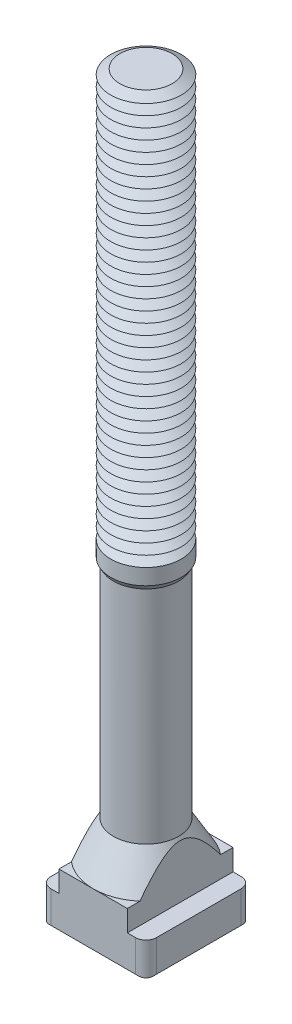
ISO-10303-21;
HEADER;
FILE_DESCRIPTION(('STEP AP214'),'2;1');
FILE_NAME('part.step','',(''),(''),'','','');
FILE_SCHEMA(('AUTOMOTIVE_DESIGN { 1 0 10303 214 1 1 1 1 }'));
ENDSEC;
DATA;
#1=APPLICATION_CONTEXT('core data for automotive mechanical design processes');
#2=APPLICATION_PROTOCOL_DEFINITION('international standard','automotive_design',2000,#1);
#3=PRODUCT_CONTEXT('',#1,'mechanical');
#4=PRODUCT('Part','Part','',(#3));
#5=PRODUCT_RELATED_PRODUCT_CATEGORY('part','',(#4));
#6=PRODUCT_DEFINITION_FORMATION('','',#4);
#7=PRODUCT_DEFINITION_CONTEXT('part definition',#1,'design');
#8=PRODUCT_DEFINITION('design','',#6,#7);
#9=PRODUCT_DEFINITION_SHAPE('','',#8);
#10=(LENGTH_UNIT() NAMED_UNIT(*) SI_UNIT(.MILLI.,.METRE.));
#11=(NAMED_UNIT(*) PLANE_ANGLE_UNIT() SI_UNIT($,.RADIAN.));
#12=(NAMED_UNIT(*) SI_UNIT($,.STERADIAN.) SOLID_ANGLE_UNIT());
#13=UNCERTAINTY_MEASURE_WITH_UNIT(LENGTH_MEASURE(1.E-05),#10,'distance_accuracy_value','');
#14=(GEOMETRIC_REPRESENTATION_CONTEXT(3) GLOBAL_UNCERTAINTY_ASSIGNED_CONTEXT((#13)) GLOBAL_UNIT_ASSIGNED_CONTEXT((#10,
#11,#12)) REPRESENTATION_CONTEXT('',''));
#15=CARTESIAN_POINT('',(0.,0.,0.));
#16=DIRECTION('',(0.,0.,1.));
#17=DIRECTION('',(1.,0.,0.));
#18=AXIS2_PLACEMENT_3D('',#15,#16,#17);
#19=CARTESIAN_POINT('',(0.,100.,0.));
#20=DIRECTION('',(0.,-1.,0.));
#21=DIRECTION('',(0.,0.,-1.));
#22=AXIS2_PLACEMENT_3D('',#19,#20,#21);
#23=CONICAL_SURFACE('',#22,3.70096189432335,1.0471975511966);
#24=CARTESIAN_POINT('',(0.,99.25,0.));
#25=DIRECTION('',(0.,-1.,0.));
#26=DIRECTION('',(0.,0.,-1.));
#27=AXIS2_PLACEMENT_3D('',#24,#25,#26);
#28=CIRCLE('',#27,5.00000000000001);
#29=CARTESIAN_POINT('',(0.,99.25,-5.00000000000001));
#30=VERTEX_POINT('',#29);
#31=EDGE_CURVE('E802',#30,#30,#28,.T.);
#32=ORIENTED_EDGE('',*,*,#31,.F.);
#33=EDGE_LOOP('',(#32));
#34=FACE_BOUND('',#33,.T.);
#35=CARTESIAN_POINT('',(0.,100.,0.));
#36=DIRECTION('',(0.,-1.,0.));
#37=DIRECTION('',(0.,0.,-1.));
#38=AXIS2_PLACEMENT_3D('',#35,#36,#37);
#39=CIRCLE('',#38,3.70096189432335);
#40=CARTESIAN_POINT('',(0.,100.,-3.70096189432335));
#41=VERTEX_POINT('',#40);
#42=EDGE_CURVE('E662',#41,#41,#39,.T.);
#43=ORIENTED_EDGE('',*,*,#42,.T.);
#44=EDGE_LOOP('',(#43));
#45=FACE_BOUND('',#44,.T.);
#46=ADVANCED_FACE('F39',(#34,#45),#23,.T.);
#47=CARTESIAN_POINT('',(0.,100.75,0.));
#48=DIRECTION('',(0.,1.,0.));
#49=DIRECTION('',(0.,0.,1.));
#50=AXIS2_PLACEMENT_3D('',#47,#48,#49);
#51=CONICAL_SURFACE('',#50,5.00000000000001,1.0471975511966);
#52=ORIENTED_EDGE('',*,*,#42,.F.);
#53=EDGE_LOOP('',(#52));
#54=FACE_BOUND('',#53,.T.);
#55=CARTESIAN_POINT('',(0.,100.75,0.));
#56=DIRECTION('',(0.,-1.,0.));
#57=DIRECTION('',(0.,0.,-1.));
#58=AXIS2_PLACEMENT_3D('',#55,#56,#57);
#59=CIRCLE('',#58,5.00000000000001);
#60=CARTESIAN_POINT('',(0.,100.75,-5.00000000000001));
#61=VERTEX_POINT('',#60);
#62=EDGE_CURVE('E658',#61,#61,#59,.T.);
#63=ORIENTED_EDGE('',*,*,#62,.T.);
#64=EDGE_LOOP('',(#63));
#65=FACE_BOUND('',#64,.T.);
#66=ADVANCED_FACE('F448',(#54,#65),#51,.T.);
#67=CARTESIAN_POINT('',(2.4997509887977,106.,0.));
#68=DIRECTION('',(0.,-1.,0.));
#69=DIRECTION('',(1.,0.,0.));
#70=AXIS2_PLACEMENT_3D('',#67,#68,#69);
#71=PLANE('',#70);
#72=CARTESIAN_POINT('',(0.,106.,0.));
#73=DIRECTION('',(0.,-1.,0.));
#74=DIRECTION('',(0.,0.,-1.));
#75=AXIS2_PLACEMENT_3D('',#72,#73,#74);
#76=CIRCLE('',#75,3.70096189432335);
#77=CARTESIAN_POINT('',(0.,106.,-3.70096189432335));
#78=VERTEX_POINT('',#77);
#79=EDGE_CURVE('E737',#78,#78,#76,.T.);
#80=ORIENTED_EDGE('',*,*,#79,.F.);
#81=EDGE_LOOP('',(#80));
#82=FACE_BOUND('',#81,.T.);
#83=ADVANCED_FACE('F454',(#82),#71,.F.);
#84=CARTESIAN_POINT('',(0.,106.,0.));
#85=DIRECTION('',(0.,-1.,0.));
#86=DIRECTION('',(0.,0.,-1.));
#87=AXIS2_PLACEMENT_3D('',#84,#85,#86);
#88=CONICAL_SURFACE('',#87,3.70096189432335,1.0471975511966);
#89=CARTESIAN_POINT('',(0.,105.25,0.));
#90=DIRECTION('',(0.,-1.,0.));
#91=DIRECTION('',(0.,0.,-1.));
#92=AXIS2_PLACEMENT_3D('',#89,#90,#91);
#93=CIRCLE('',#92,5.00000000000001);
#94=CARTESIAN_POINT('',(0.,105.25,-5.00000000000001));
#95=VERTEX_POINT('',#94);
#96=EDGE_CURVE('E733',#95,#95,#93,.T.);
#97=ORIENTED_EDGE('',*,*,#96,.F.);
#98=EDGE_LOOP('',(#97));
#99=FACE_BOUND('',#98,.T.);
#100=ORIENTED_EDGE('',*,*,#79,.T.);
#101=EDGE_LOOP('',(#100));
#102=FACE_BOUND('',#101,.T.);
#103=ADVANCED_FACE('F482',(#99,#102),#88,.T.);
#104=CARTESIAN_POINT('',(0.,105.25,0.));
#105=DIRECTION('',(0.,1.,0.));
#106=DIRECTION('',(0.,0.,1.));
#107=AXIS2_PLACEMENT_3D('',#104,#105,#106);
#108=CONICAL_SURFACE('',#107,5.00000000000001,1.0471975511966);
#109=CARTESIAN_POINT('',(0.,104.5,0.));
#110=DIRECTION('',(0.,-1.,0.));
#111=DIRECTION('',(0.,0.,-1.));
#112=AXIS2_PLACEMENT_3D('',#109,#110,#111);
#113=CIRCLE('',#112,3.70096189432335);
#114=CARTESIAN_POINT('',(0.,104.5,-3.70096189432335));
#115=VERTEX_POINT('',#114);
#116=EDGE_CURVE('E723',#115,#115,#113,.T.);
#117=ORIENTED_EDGE('',*,*,#116,.F.);
#118=EDGE_LOOP('',(#117));
#119=FACE_BOUND('',#118,.T.);
#120=ORIENTED_EDGE('',*,*,#96,.T.);
#121=EDGE_LOOP('',(#120));
#122=FACE_BOUND('',#121,.T.);
#123=ADVANCED_FACE('F479',(#119,#122),#108,.T.);
#124=CARTESIAN_POINT('',(0.,104.5,0.));
#125=DIRECTION('',(0.,-1.,0.));
#126=DIRECTION('',(0.,0.,-1.));
#127=AXIS2_PLACEMENT_3D('',#124,#125,#126);
#128=CONICAL_SURFACE('',#127,3.70096189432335,1.0471975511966);
#129=CARTESIAN_POINT('',(0.,103.75,0.));
#130=DIRECTION('',(0.,-1.,0.));
#131=DIRECTION('',(0.,0.,-1.));
#132=AXIS2_PLACEMENT_3D('',#129,#130,#131);
#133=CIRCLE('',#132,5.00000000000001);
#134=CARTESIAN_POINT('',(0.,103.75,-5.00000000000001));
#135=VERTEX_POINT('',#134);
#136=EDGE_CURVE('E716',#135,#135,#133,.T.);
#137=ORIENTED_EDGE('',*,*,#136,.F.);
#138=EDGE_LOOP('',(#137));
#139=FACE_BOUND('',#138,.T.);
#140=ORIENTED_EDGE('',*,*,#116,.T.);
#141=EDGE_LOOP('',(#140));
#142=FACE_BOUND('',#141,.T.);
#143=ADVANCED_FACE('F474',(#139,#142),#128,.T.);
#144=CARTESIAN_POINT('',(0.,103.75,0.));
#145=DIRECTION('',(0.,1.,0.));
#146=DIRECTION('',(0.,0.,1.));
#147=AXIS2_PLACEMENT_3D('',#144,#145,#146);
#148=CONICAL_SURFACE('',#147,5.00000000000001,1.0471975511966);
#149=CARTESIAN_POINT('',(0.,103.,0.));
#150=DIRECTION('',(0.,-1.,0.));
#151=DIRECTION('',(0.,0.,-1.));
#152=AXIS2_PLACEMENT_3D('',#149,#150,#151);
#153=CIRCLE('',#152,3.70096189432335);
#154=CARTESIAN_POINT('',(0.,103.,-3.70096189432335));
#155=VERTEX_POINT('',#154);
#156=EDGE_CURVE('E714',#155,#155,#153,.T.);
#157=ORIENTED_EDGE('',*,*,#156,.F.);
#158=EDGE_LOOP('',(#157));
#159=FACE_BOUND('',#158,.T.);
#160=ORIENTED_EDGE('',*,*,#136,.T.);
#161=EDGE_LOOP('',(#160));
#162=FACE_BOUND('',#161,.T.);
#163=ADVANCED_FACE('F471',(#159,#162),#148,.T.);
#164=CARTESIAN_POINT('',(0.,103.,0.));
#165=DIRECTION('',(0.,-1.,0.));
#166=DIRECTION('',(0.,0.,-1.));
#167=AXIS2_PLACEMENT_3D('',#164,#165,#166);
#168=CONICAL_SURFACE('',#167,3.70096189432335,1.0471975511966);
#169=CARTESIAN_POINT('',(0.,102.25,0.));
#170=DIRECTION('',(0.,-1.,0.));
#171=DIRECTION('',(0.,0.,-1.));
#172=AXIS2_PLACEMENT_3D('',#169,#170,#171);
#173=CIRCLE('',#172,5.00000000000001);
#174=CARTESIAN_POINT('',(0.,102.25,-5.00000000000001));
#175=VERTEX_POINT('',#174);
#176=EDGE_CURVE('E717',#175,#175,#173,.T.);
#177=ORIENTED_EDGE('',*,*,#176,.F.);
#178=EDGE_LOOP('',(#177));
#179=FACE_BOUND('',#178,.T.);
#180=ORIENTED_EDGE('',*,*,#156,.T.);
#181=EDGE_LOOP('',(#180));
#182=FACE_BOUND('',#181,.T.);
#183=ADVANCED_FACE('F465',(#179,#182),#168,.T.);
#184=CARTESIAN_POINT('',(0.,102.25,0.));
#185=DIRECTION('',(0.,1.,0.));
#186=DIRECTION('',(0.,0.,1.));
#187=AXIS2_PLACEMENT_3D('',#184,#185,#186);
#188=CONICAL_SURFACE('',#187,5.00000000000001,1.0471975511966);
#189=CARTESIAN_POINT('',(0.,101.5,0.));
#190=DIRECTION('',(0.,-1.,0.));
#191=DIRECTION('',(0.,0.,-1.));
#192=AXIS2_PLACEMENT_3D('',#189,#190,#191);
#193=CIRCLE('',#192,3.70096189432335);
#194=CARTESIAN_POINT('',(0.,101.5,-3.70096189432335));
#195=VERTEX_POINT('',#194);
#196=EDGE_CURVE('E661',#195,#195,#193,.T.);
#197=ORIENTED_EDGE('',*,*,#196,.F.);
#198=EDGE_LOOP('',(#197));
#199=FACE_BOUND('',#198,.T.);
#200=ORIENTED_EDGE('',*,*,#176,.T.);
#201=EDGE_LOOP('',(#200));
#202=FACE_BOUND('',#201,.T.);
#203=ADVANCED_FACE('F461',(#199,#202),#188,.T.);
#204=CARTESIAN_POINT('',(0.,101.5,0.));
#205=DIRECTION('',(0.,-1.,0.));
#206=DIRECTION('',(0.,0.,-1.));
#207=AXIS2_PLACEMENT_3D('',#204,#205,#206);
#208=CONICAL_SURFACE('',#207,3.70096189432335,1.0471975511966);
#209=ORIENTED_EDGE('',*,*,#62,.F.);
#210=EDGE_LOOP('',(#209));
#211=FACE_BOUND('',#210,.T.);
#212=ORIENTED_EDGE('',*,*,#196,.T.);
#213=EDGE_LOOP('',(#212));
#214=FACE_BOUND('',#213,.T.);
#215=ADVANCED_FACE('F464',(#211,#214),#208,.T.);
#216=CARTESIAN_POINT('',(0.,98.5,0.));
#217=DIRECTION('',(0.,-1.,0.));
#218=DIRECTION('',(0.,0.,-1.));
#219=AXIS2_PLACEMENT_3D('',#216,#217,#218);
#220=CONICAL_SURFACE('',#219,3.70096189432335,1.0471975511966);
#221=CARTESIAN_POINT('',(0.,97.75,0.));
#222=DIRECTION('',(0.,-1.,0.));
#223=DIRECTION('',(0.,0.,-1.));
#224=AXIS2_PLACEMENT_3D('',#221,#222,#223);
#225=CIRCLE('',#224,5.00000000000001);
#226=CARTESIAN_POINT('',(0.,97.75,-5.00000000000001));
#227=VERTEX_POINT('',#226);
#228=EDGE_CURVE('E652',#227,#227,#225,.T.);
#229=ORIENTED_EDGE('',*,*,#228,.F.);
#230=EDGE_LOOP('',(#229));
#231=FACE_BOUND('',#230,.T.);
#232=CARTESIAN_POINT('',(0.,98.5,0.));
#233=DIRECTION('',(0.,-1.,0.));
#234=DIRECTION('',(0.,0.,-1.));
#235=AXIS2_PLACEMENT_3D('',#232,#233,#234);
#236=CIRCLE('',#235,3.70096189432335);
#237=CARTESIAN_POINT('',(0.,98.5,-3.70096189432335));
#238=VERTEX_POINT('',#237);
#239=EDGE_CURVE('E655',#238,#238,#236,.T.);
#240=ORIENTED_EDGE('',*,*,#239,.T.);
#241=EDGE_LOOP('',(#240));
#242=FACE_BOUND('',#241,.T.);
#243=ADVANCED_FACE('F469',(#231,#242),#220,.T.);
#244=CARTESIAN_POINT('',(0.,99.25,0.));
#245=DIRECTION('',(0.,1.,0.));
#246=DIRECTION('',(0.,0.,1.));
#247=AXIS2_PLACEMENT_3D('',#244,#245,#246);
#248=CONICAL_SURFACE('',#247,5.00000000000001,1.0471975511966);
#249=ORIENTED_EDGE('',*,*,#239,.F.);
#250=EDGE_LOOP('',(#249));
#251=FACE_BOUND('',#250,.T.);
#252=ORIENTED_EDGE('',*,*,#31,.T.);
#253=EDGE_LOOP('',(#252));
#254=FACE_BOUND('',#253,.T.);
#255=ADVANCED_FACE('F1093',(#251,#254),#248,.T.);
#256=CARTESIAN_POINT('',(0.,97.,0.));
#257=DIRECTION('',(0.,-1.,0.));
#258=DIRECTION('',(0.,0.,-1.));
#259=AXIS2_PLACEMENT_3D('',#256,#257,#258);
#260=CONICAL_SURFACE('',#259,3.70096189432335,1.0471975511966);
#261=CARTESIAN_POINT('',(0.,96.25,0.));
#262=DIRECTION('',(0.,-1.,0.));
#263=DIRECTION('',(0.,0.,-1.));
#264=AXIS2_PLACEMENT_3D('',#261,#262,#263);
#265=CIRCLE('',#264,5.00000000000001);
#266=CARTESIAN_POINT('',(0.,96.25,-5.00000000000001));
#267=VERTEX_POINT('',#266);
#268=EDGE_CURVE('E712',#267,#267,#265,.T.);
#269=ORIENTED_EDGE('',*,*,#268,.F.);
#270=EDGE_LOOP('',(#269));
#271=FACE_BOUND('',#270,.T.);
#272=CARTESIAN_POINT('',(0.,97.,0.));
#273=DIRECTION('',(0.,-1.,0.));
#274=DIRECTION('',(0.,0.,-1.));
#275=AXIS2_PLACEMENT_3D('',#272,#273,#274);
#276=CIRCLE('',#275,3.70096189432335);
#277=CARTESIAN_POINT('',(0.,97.,-3.70096189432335));
#278=VERTEX_POINT('',#277);
#279=EDGE_CURVE('E656',#278,#278,#276,.T.);
#280=ORIENTED_EDGE('',*,*,#279,.T.);
#281=EDGE_LOOP('',(#280));
#282=FACE_BOUND('',#281,.T.);
#283=ADVANCED_FACE('F1089',(#271,#282),#260,.T.);
#284=CARTESIAN_POINT('',(0.,97.75,0.));
#285=DIRECTION('',(0.,1.,0.));
#286=DIRECTION('',(0.,0.,1.));
#287=AXIS2_PLACEMENT_3D('',#284,#285,#286);
#288=CONICAL_SURFACE('',#287,5.00000000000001,1.0471975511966);
#289=ORIENTED_EDGE('',*,*,#279,.F.);
#290=EDGE_LOOP('',(#289));
#291=FACE_BOUND('',#290,.T.);
#292=ORIENTED_EDGE('',*,*,#228,.T.);
#293=EDGE_LOOP('',(#292));
#294=FACE_BOUND('',#293,.T.);
#295=ADVANCED_FACE('F1085',(#291,#294),#288,.T.);
#296=CARTESIAN_POINT('',(0.,95.5,0.));
#297=DIRECTION('',(0.,-1.,0.));
#298=DIRECTION('',(0.,0.,-1.));
#299=AXIS2_PLACEMENT_3D('',#296,#297,#298);
#300=CONICAL_SURFACE('',#299,3.70096189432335,1.0471975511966);
#301=CARTESIAN_POINT('',(0.,94.75,0.));
#302=DIRECTION('',(0.,-1.,0.));
#303=DIRECTION('',(0.,0.,-1.));
#304=AXIS2_PLACEMENT_3D('',#301,#302,#303);
#305=CIRCLE('',#304,5.00000000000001);
#306=CARTESIAN_POINT('',(0.,94.75,-5.00000000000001));
#307=VERTEX_POINT('',#306);
#308=EDGE_CURVE('E670',#307,#307,#305,.T.);
#309=ORIENTED_EDGE('',*,*,#308,.F.);
#310=EDGE_LOOP('',(#309));
#311=FACE_BOUND('',#310,.T.);
#312=CARTESIAN_POINT('',(0.,95.5,0.));
#313=DIRECTION('',(0.,-1.,0.));
#314=DIRECTION('',(0.,0.,-1.));
#315=AXIS2_PLACEMENT_3D('',#312,#313,#314);
#316=CIRCLE('',#315,3.70096189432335);
#317=CARTESIAN_POINT('',(0.,95.5,-3.70096189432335));
#318=VERTEX_POINT('',#317);
#319=EDGE_CURVE('E784',#318,#318,#316,.T.);
#320=ORIENTED_EDGE('',*,*,#319,.T.);
#321=EDGE_LOOP('',(#320));
#322=FACE_BOUND('',#321,.T.);
#323=ADVANCED_FACE('F1081',(#311,#322),#300,.T.);
#324=CARTESIAN_POINT('',(0.,96.25,0.));
#325=DIRECTION('',(0.,1.,0.));
#326=DIRECTION('',(0.,0.,1.));
#327=AXIS2_PLACEMENT_3D('',#324,#325,#326);
#328=CONICAL_SURFACE('',#327,5.00000000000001,1.0471975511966);
#329=ORIENTED_EDGE('',*,*,#319,.F.);
#330=EDGE_LOOP('',(#329));
#331=FACE_BOUND('',#330,.T.);
#332=ORIENTED_EDGE('',*,*,#268,.T.);
#333=EDGE_LOOP('',(#332));
#334=FACE_BOUND('',#333,.T.);
#335=ADVANCED_FACE('F1077',(#331,#334),#328,.T.);
#336=CARTESIAN_POINT('',(0.,94.,0.));
#337=DIRECTION('',(0.,-1.,0.));
#338=DIRECTION('',(0.,0.,-1.));
#339=AXIS2_PLACEMENT_3D('',#336,#337,#338);
#340=CONICAL_SURFACE('',#339,3.70096189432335,1.0471975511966);
#341=CARTESIAN_POINT('',(0.,93.25,0.));
#342=DIRECTION('',(0.,-1.,0.));
#343=DIRECTION('',(0.,0.,-1.));
#344=AXIS2_PLACEMENT_3D('',#341,#342,#343);
#345=CIRCLE('',#344,5.00000000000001);
#346=CARTESIAN_POINT('',(0.,93.25,-5.00000000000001));
#347=VERTEX_POINT('',#346);
#348=EDGE_CURVE('E671',#347,#347,#345,.T.);
#349=ORIENTED_EDGE('',*,*,#348,.F.);
#350=EDGE_LOOP('',(#349));
#351=FACE_BOUND('',#350,.T.);
#352=CARTESIAN_POINT('',(0.,94.,0.));
#353=DIRECTION('',(0.,-1.,0.));
#354=DIRECTION('',(0.,0.,-1.));
#355=AXIS2_PLACEMENT_3D('',#352,#353,#354);
#356=CIRCLE('',#355,3.70096189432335);
#357=CARTESIAN_POINT('',(0.,94.,-3.70096189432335));
#358=VERTEX_POINT('',#357);
#359=EDGE_CURVE('E668',#358,#358,#356,.T.);
#360=ORIENTED_EDGE('',*,*,#359,.T.);
#361=EDGE_LOOP('',(#360));
#362=FACE_BOUND('',#361,.T.);
#363=ADVANCED_FACE('F1073',(#351,#362),#340,.T.);
#364=CARTESIAN_POINT('',(0.,94.75,0.));
#365=DIRECTION('',(0.,1.,0.));
#366=DIRECTION('',(0.,0.,1.));
#367=AXIS2_PLACEMENT_3D('',#364,#365,#366);
#368=CONICAL_SURFACE('',#367,5.00000000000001,1.0471975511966);
#369=ORIENTED_EDGE('',*,*,#359,.F.);
#370=EDGE_LOOP('',(#369));
#371=FACE_BOUND('',#370,.T.);
#372=ORIENTED_EDGE('',*,*,#308,.T.);
#373=EDGE_LOOP('',(#372));
#374=FACE_BOUND('',#373,.T.);
#375=ADVANCED_FACE('F1069',(#371,#374),#368,.T.);
#376=CARTESIAN_POINT('',(0.,92.5,0.));
#377=DIRECTION('',(0.,-1.,0.));
#378=DIRECTION('',(0.,0.,-1.));
#379=AXIS2_PLACEMENT_3D('',#376,#377,#378);
#380=CONICAL_SURFACE('',#379,3.70096189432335,1.0471975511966);
#381=CARTESIAN_POINT('',(0.,91.75,0.));
#382=DIRECTION('',(0.,-1.,0.));
#383=DIRECTION('',(0.,0.,-1.));
#384=AXIS2_PLACEMENT_3D('',#381,#382,#383);
#385=CIRCLE('',#384,5.00000000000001);
#386=CARTESIAN_POINT('',(0.,91.75,-5.00000000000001));
#387=VERTEX_POINT('',#386);
#388=EDGE_CURVE('E707',#387,#387,#385,.T.);
#389=ORIENTED_EDGE('',*,*,#388,.F.);
#390=EDGE_LOOP('',(#389));
#391=FACE_BOUND('',#390,.T.);
#392=CARTESIAN_POINT('',(0.,92.5,0.));
#393=DIRECTION('',(0.,-1.,0.));
#394=DIRECTION('',(0.,0.,-1.));
#395=AXIS2_PLACEMENT_3D('',#392,#393,#394);
#396=CIRCLE('',#395,3.70096189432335);
#397=CARTESIAN_POINT('',(0.,92.5,-3.70096189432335));
#398=VERTEX_POINT('',#397);
#399=EDGE_CURVE('E874',#398,#398,#396,.T.);
#400=ORIENTED_EDGE('',*,*,#399,.T.);
#401=EDGE_LOOP('',(#400));
#402=FACE_BOUND('',#401,.T.);
#403=ADVANCED_FACE('F1065',(#391,#402),#380,.T.);
#404=CARTESIAN_POINT('',(0.,93.25,0.));
#405=DIRECTION('',(0.,1.,0.));
#406=DIRECTION('',(0.,0.,1.));
#407=AXIS2_PLACEMENT_3D('',#404,#405,#406);
#408=CONICAL_SURFACE('',#407,5.00000000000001,1.0471975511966);
#409=ORIENTED_EDGE('',*,*,#399,.F.);
#410=EDGE_LOOP('',(#409));
#411=FACE_BOUND('',#410,.T.);
#412=ORIENTED_EDGE('',*,*,#348,.T.);
#413=EDGE_LOOP('',(#412));
#414=FACE_BOUND('',#413,.T.);
#415=ADVANCED_FACE('F1061',(#411,#414),#408,.T.);
#416=CARTESIAN_POINT('',(0.,91.,0.));
#417=DIRECTION('',(0.,-1.,0.));
#418=DIRECTION('',(0.,0.,-1.));
#419=AXIS2_PLACEMENT_3D('',#416,#417,#418);
#420=CONICAL_SURFACE('',#419,3.70096189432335,1.0471975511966);
#421=CARTESIAN_POINT('',(0.,90.25,0.));
#422=DIRECTION('',(0.,-1.,0.));
#423=DIRECTION('',(0.,0.,-1.));
#424=AXIS2_PLACEMENT_3D('',#421,#422,#423);
#425=CIRCLE('',#424,5.00000000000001);
#426=CARTESIAN_POINT('',(0.,90.25,-5.00000000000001));
#427=VERTEX_POINT('',#426);
#428=EDGE_CURVE('E708',#427,#427,#425,.T.);
#429=ORIENTED_EDGE('',*,*,#428,.F.);
#430=EDGE_LOOP('',(#429));
#431=FACE_BOUND('',#430,.T.);
#432=CARTESIAN_POINT('',(0.,91.,0.));
#433=DIRECTION('',(0.,-1.,0.));
#434=DIRECTION('',(0.,0.,-1.));
#435=AXIS2_PLACEMENT_3D('',#432,#433,#434);
#436=CIRCLE('',#435,3.70096189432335);
#437=CARTESIAN_POINT('',(0.,91.,-3.70096189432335));
#438=VERTEX_POINT('',#437);
#439=EDGE_CURVE('E704',#438,#438,#436,.T.);
#440=ORIENTED_EDGE('',*,*,#439,.T.);
#441=EDGE_LOOP('',(#440));
#442=FACE_BOUND('',#441,.T.);
#443=ADVANCED_FACE('F1057',(#431,#442),#420,.T.);
#444=CARTESIAN_POINT('',(0.,91.75,0.));
#445=DIRECTION('',(0.,1.,0.));
#446=DIRECTION('',(0.,0.,1.));
#447=AXIS2_PLACEMENT_3D('',#444,#445,#446);
#448=CONICAL_SURFACE('',#447,5.00000000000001,1.0471975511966);
#449=ORIENTED_EDGE('',*,*,#439,.F.);
#450=EDGE_LOOP('',(#449));
#451=FACE_BOUND('',#450,.T.);
#452=ORIENTED_EDGE('',*,*,#388,.T.);
#453=EDGE_LOOP('',(#452));
#454=FACE_BOUND('',#453,.T.);
#455=ADVANCED_FACE('F1053',(#451,#454),#448,.T.);
#456=CARTESIAN_POINT('',(0.,89.5,0.));
#457=DIRECTION('',(0.,-1.,0.));
#458=DIRECTION('',(0.,0.,-1.));
#459=AXIS2_PLACEMENT_3D('',#456,#457,#458);
#460=CONICAL_SURFACE('',#459,3.70096189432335,1.0471975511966);
#461=CARTESIAN_POINT('',(0.,88.75,0.));
#462=DIRECTION('',(0.,-1.,0.));
#463=DIRECTION('',(0.,0.,-1.));
#464=AXIS2_PLACEMENT_3D('',#461,#462,#463);
#465=CIRCLE('',#464,5.00000000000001);
#466=CARTESIAN_POINT('',(0.,88.75,-5.00000000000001));
#467=VERTEX_POINT('',#466);
#468=EDGE_CURVE('E864',#467,#467,#465,.T.);
#469=ORIENTED_EDGE('',*,*,#468,.F.);
#470=EDGE_LOOP('',(#469));
#471=FACE_BOUND('',#470,.T.);
#472=CARTESIAN_POINT('',(0.,89.5,0.));
#473=DIRECTION('',(0.,-1.,0.));
#474=DIRECTION('',(0.,0.,-1.));
#475=AXIS2_PLACEMENT_3D('',#472,#473,#474);
#476=CIRCLE('',#475,3.70096189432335);
#477=CARTESIAN_POINT('',(0.,89.5,-3.70096189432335));
#478=VERTEX_POINT('',#477);
#479=EDGE_CURVE('E781',#478,#478,#476,.T.);
#480=ORIENTED_EDGE('',*,*,#479,.T.);
#481=EDGE_LOOP('',(#480));
#482=FACE_BOUND('',#481,.T.);
#483=ADVANCED_FACE('F1049',(#471,#482),#460,.T.);
#484=CARTESIAN_POINT('',(0.,90.25,0.));
#485=DIRECTION('',(0.,1.,0.));
#486=DIRECTION('',(0.,0.,1.));
#487=AXIS2_PLACEMENT_3D('',#484,#485,#486);
#488=CONICAL_SURFACE('',#487,5.00000000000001,1.0471975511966);
#489=ORIENTED_EDGE('',*,*,#479,.F.);
#490=EDGE_LOOP('',(#489));
#491=FACE_BOUND('',#490,.T.);
#492=ORIENTED_EDGE('',*,*,#428,.T.);
#493=EDGE_LOOP('',(#492));
#494=FACE_BOUND('',#493,.T.);
#495=ADVANCED_FACE('F1045',(#491,#494),#488,.T.);
#496=CARTESIAN_POINT('',(0.,88.,0.));
#497=DIRECTION('',(0.,-1.,0.));
#498=DIRECTION('',(0.,0.,-1.));
#499=AXIS2_PLACEMENT_3D('',#496,#497,#498);
#500=CONICAL_SURFACE('',#499,3.70096189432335,1.0471975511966);
#501=CARTESIAN_POINT('',(0.,87.25,0.));
#502=DIRECTION('',(0.,-1.,0.));
#503=DIRECTION('',(0.,0.,-1.));
#504=AXIS2_PLACEMENT_3D('',#501,#502,#503);
#505=CIRCLE('',#504,5.00000000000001);
#506=CARTESIAN_POINT('',(0.,87.25,-5.00000000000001));
#507=VERTEX_POINT('',#506);
#508=EDGE_CURVE('E858',#507,#507,#505,.T.);
#509=ORIENTED_EDGE('',*,*,#508,.F.);
#510=EDGE_LOOP('',(#509));
#511=FACE_BOUND('',#510,.T.);
#512=CARTESIAN_POINT('',(0.,88.,0.));
#513=DIRECTION('',(0.,-1.,0.));
#514=DIRECTION('',(0.,0.,-1.));
#515=AXIS2_PLACEMENT_3D('',#512,#513,#514);
#516=CIRCLE('',#515,3.70096189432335);
#517=CARTESIAN_POINT('',(0.,88.,-3.70096189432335));
#518=VERTEX_POINT('',#517);
#519=EDGE_CURVE('E631',#518,#518,#516,.T.);
#520=ORIENTED_EDGE('',*,*,#519,.T.);
#521=EDGE_LOOP('',(#520));
#522=FACE_BOUND('',#521,.T.);
#523=ADVANCED_FACE('F1041',(#511,#522),#500,.T.);
#524=CARTESIAN_POINT('',(0.,88.75,0.));
#525=DIRECTION('',(0.,1.,0.));
#526=DIRECTION('',(0.,0.,1.));
#527=AXIS2_PLACEMENT_3D('',#524,#525,#526);
#528=CONICAL_SURFACE('',#527,5.00000000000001,1.0471975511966);
#529=ORIENTED_EDGE('',*,*,#519,.F.);
#530=EDGE_LOOP('',(#529));
#531=FACE_BOUND('',#530,.T.);
#532=ORIENTED_EDGE('',*,*,#468,.T.);
#533=EDGE_LOOP('',(#532));
#534=FACE_BOUND('',#533,.T.);
#535=ADVANCED_FACE('F1037',(#531,#534),#528,.T.);
#536=CARTESIAN_POINT('',(0.,86.5,0.));
#537=DIRECTION('',(0.,-1.,0.));
#538=DIRECTION('',(0.,0.,-1.));
#539=AXIS2_PLACEMENT_3D('',#536,#537,#538);
#540=CONICAL_SURFACE('',#539,3.70096189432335,1.0471975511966);
#541=CARTESIAN_POINT('',(0.,85.75,0.));
#542=DIRECTION('',(0.,-1.,0.));
#543=DIRECTION('',(0.,0.,-1.));
#544=AXIS2_PLACEMENT_3D('',#541,#542,#543);
#545=CIRCLE('',#544,5.00000000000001);
#546=CARTESIAN_POINT('',(0.,85.75,-5.00000000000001));
#547=VERTEX_POINT('',#546);
#548=EDGE_CURVE('E850',#547,#547,#545,.T.);
#549=ORIENTED_EDGE('',*,*,#548,.F.);
#550=EDGE_LOOP('',(#549));
#551=FACE_BOUND('',#550,.T.);
#552=CARTESIAN_POINT('',(0.,86.5,0.));
#553=DIRECTION('',(0.,-1.,0.));
#554=DIRECTION('',(0.,0.,-1.));
#555=AXIS2_PLACEMENT_3D('',#552,#553,#554);
#556=CIRCLE('',#555,3.70096189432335);
#557=CARTESIAN_POINT('',(0.,86.5,-3.70096189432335));
#558=VERTEX_POINT('',#557);
#559=EDGE_CURVE('E854',#558,#558,#556,.T.);
#560=ORIENTED_EDGE('',*,*,#559,.T.);
#561=EDGE_LOOP('',(#560));
#562=FACE_BOUND('',#561,.T.);
#563=ADVANCED_FACE('F1033',(#551,#562),#540,.T.);
#564=CARTESIAN_POINT('',(0.,87.25,0.));
#565=DIRECTION('',(0.,1.,0.));
#566=DIRECTION('',(0.,0.,1.));
#567=AXIS2_PLACEMENT_3D('',#564,#565,#566);
#568=CONICAL_SURFACE('',#567,5.00000000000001,1.0471975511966);
#569=ORIENTED_EDGE('',*,*,#559,.F.);
#570=EDGE_LOOP('',(#569));
#571=FACE_BOUND('',#570,.T.);
#572=ORIENTED_EDGE('',*,*,#508,.T.);
#573=EDGE_LOOP('',(#572));
#574=FACE_BOUND('',#573,.T.);
#575=ADVANCED_FACE('F1029',(#571,#574),#568,.T.);
#576=CARTESIAN_POINT('',(0.,85.,0.));
#577=DIRECTION('',(0.,-1.,0.));
#578=DIRECTION('',(0.,0.,-1.));
#579=AXIS2_PLACEMENT_3D('',#576,#577,#578);
#580=CONICAL_SURFACE('',#579,3.70096189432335,1.0471975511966);
#581=CARTESIAN_POINT('',(0.,84.25,0.));
#582=DIRECTION('',(0.,-1.,0.));
#583=DIRECTION('',(0.,0.,-1.));
#584=AXIS2_PLACEMENT_3D('',#581,#582,#583);
#585=CIRCLE('',#584,5.00000000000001);
#586=CARTESIAN_POINT('',(0.,84.25,-5.00000000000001));
#587=VERTEX_POINT('',#586);
#588=EDGE_CURVE('E842',#587,#587,#585,.T.);
#589=ORIENTED_EDGE('',*,*,#588,.F.);
#590=EDGE_LOOP('',(#589));
#591=FACE_BOUND('',#590,.T.);
#592=CARTESIAN_POINT('',(0.,85.,0.));
#593=DIRECTION('',(0.,-1.,0.));
#594=DIRECTION('',(0.,0.,-1.));
#595=AXIS2_PLACEMENT_3D('',#592,#593,#594);
#596=CIRCLE('',#595,3.70096189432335);
#597=CARTESIAN_POINT('',(0.,85.,-3.70096189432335));
#598=VERTEX_POINT('',#597);
#599=EDGE_CURVE('E846',#598,#598,#596,.T.);
#600=ORIENTED_EDGE('',*,*,#599,.T.);
#601=EDGE_LOOP('',(#600));
#602=FACE_BOUND('',#601,.T.);
#603=ADVANCED_FACE('F1025',(#591,#602),#580,.T.);
#604=CARTESIAN_POINT('',(0.,85.75,0.));
#605=DIRECTION('',(0.,1.,0.));
#606=DIRECTION('',(0.,0.,1.));
#607=AXIS2_PLACEMENT_3D('',#604,#605,#606);
#608=CONICAL_SURFACE('',#607,5.00000000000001,1.0471975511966);
#609=ORIENTED_EDGE('',*,*,#599,.F.);
#610=EDGE_LOOP('',(#609));
#611=FACE_BOUND('',#610,.T.);
#612=ORIENTED_EDGE('',*,*,#548,.T.);
#613=EDGE_LOOP('',(#612));
#614=FACE_BOUND('',#613,.T.);
#615=ADVANCED_FACE('F1021',(#611,#614),#608,.T.);
#616=CARTESIAN_POINT('',(0.,83.5,0.));
#617=DIRECTION('',(0.,-1.,0.));
#618=DIRECTION('',(0.,0.,-1.));
#619=AXIS2_PLACEMENT_3D('',#616,#617,#618);
#620=CONICAL_SURFACE('',#619,3.70096189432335,1.0471975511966);
#621=CARTESIAN_POINT('',(0.,82.75,0.));
#622=DIRECTION('',(0.,-1.,0.));
#623=DIRECTION('',(0.,0.,-1.));
#624=AXIS2_PLACEMENT_3D('',#621,#622,#623);
#625=CIRCLE('',#624,5.00000000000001);
#626=CARTESIAN_POINT('',(0.,82.75,-5.00000000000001));
#627=VERTEX_POINT('',#626);
#628=EDGE_CURVE('E646',#627,#627,#625,.T.);
#629=ORIENTED_EDGE('',*,*,#628,.F.);
#630=EDGE_LOOP('',(#629));
#631=FACE_BOUND('',#630,.T.);
#632=CARTESIAN_POINT('',(0.,83.5,0.));
#633=DIRECTION('',(0.,-1.,0.));
#634=DIRECTION('',(0.,0.,-1.));
#635=AXIS2_PLACEMENT_3D('',#632,#633,#634);
#636=CIRCLE('',#635,3.70096189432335);
#637=CARTESIAN_POINT('',(0.,83.5,-3.70096189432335));
#638=VERTEX_POINT('',#637);
#639=EDGE_CURVE('E649',#638,#638,#636,.T.);
#640=ORIENTED_EDGE('',*,*,#639,.T.);
#641=EDGE_LOOP('',(#640));
#642=FACE_BOUND('',#641,.T.);
#643=ADVANCED_FACE('F1017',(#631,#642),#620,.T.);
#644=CARTESIAN_POINT('',(0.,84.25,0.));
#645=DIRECTION('',(0.,1.,0.));
#646=DIRECTION('',(0.,0.,1.));
#647=AXIS2_PLACEMENT_3D('',#644,#645,#646);
#648=CONICAL_SURFACE('',#647,5.00000000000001,1.0471975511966);
#649=ORIENTED_EDGE('',*,*,#639,.F.);
#650=EDGE_LOOP('',(#649));
#651=FACE_BOUND('',#650,.T.);
#652=ORIENTED_EDGE('',*,*,#588,.T.);
#653=EDGE_LOOP('',(#652));
#654=FACE_BOUND('',#653,.T.);
#655=ADVANCED_FACE('F1013',(#651,#654),#648,.T.);
#656=CARTESIAN_POINT('',(0.,82.,0.));
#657=DIRECTION('',(0.,-1.,0.));
#658=DIRECTION('',(0.,0.,-1.));
#659=AXIS2_PLACEMENT_3D('',#656,#657,#658);
#660=CONICAL_SURFACE('',#659,3.70096189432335,1.0471975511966);
#661=CARTESIAN_POINT('',(0.,81.25,0.));
#662=DIRECTION('',(0.,-1.,0.));
#663=DIRECTION('',(0.,0.,-1.));
#664=AXIS2_PLACEMENT_3D('',#661,#662,#663);
#665=CIRCLE('',#664,5.00000000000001);
#666=CARTESIAN_POINT('',(0.,81.25,-5.00000000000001));
#667=VERTEX_POINT('',#666);
#668=EDGE_CURVE('E702',#667,#667,#665,.T.);
#669=ORIENTED_EDGE('',*,*,#668,.F.);
#670=EDGE_LOOP('',(#669));
#671=FACE_BOUND('',#670,.T.);
#672=CARTESIAN_POINT('',(0.,82.,0.));
#673=DIRECTION('',(0.,-1.,0.));
#674=DIRECTION('',(0.,0.,-1.));
#675=AXIS2_PLACEMENT_3D('',#672,#673,#674);
#676=CIRCLE('',#675,3.70096189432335);
#677=CARTESIAN_POINT('',(0.,82.,-3.70096189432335));
#678=VERTEX_POINT('',#677);
#679=EDGE_CURVE('E650',#678,#678,#676,.T.);
#680=ORIENTED_EDGE('',*,*,#679,.T.);
#681=EDGE_LOOP('',(#680));
#682=FACE_BOUND('',#681,.T.);
#683=ADVANCED_FACE('F1009',(#671,#682),#660,.T.);
#684=CARTESIAN_POINT('',(0.,82.75,0.));
#685=DIRECTION('',(0.,1.,0.));
#686=DIRECTION('',(0.,0.,1.));
#687=AXIS2_PLACEMENT_3D('',#684,#685,#686);
#688=CONICAL_SURFACE('',#687,5.00000000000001,1.0471975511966);
#689=ORIENTED_EDGE('',*,*,#679,.F.);
#690=EDGE_LOOP('',(#689));
#691=FACE_BOUND('',#690,.T.);
#692=ORIENTED_EDGE('',*,*,#628,.T.);
#693=EDGE_LOOP('',(#692));
#694=FACE_BOUND('',#693,.T.);
#695=ADVANCED_FACE('F1005',(#691,#694),#688,.T.);
#696=CARTESIAN_POINT('',(0.,80.5,0.));
#697=DIRECTION('',(0.,-1.,0.));
#698=DIRECTION('',(0.,0.,-1.));
#699=AXIS2_PLACEMENT_3D('',#696,#697,#698);
#700=CONICAL_SURFACE('',#699,3.70096189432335,1.0471975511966);
#701=CARTESIAN_POINT('',(0.,79.75,0.));
#702=DIRECTION('',(0.,-1.,0.));
#703=DIRECTION('',(0.,0.,-1.));
#704=AXIS2_PLACEMENT_3D('',#701,#702,#703);
#705=CIRCLE('',#704,5.00000000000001);
#706=CARTESIAN_POINT('',(0.,79.75,-5.00000000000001));
#707=VERTEX_POINT('',#706);
#708=EDGE_CURVE('E696',#707,#707,#705,.T.);
#709=ORIENTED_EDGE('',*,*,#708,.F.);
#710=EDGE_LOOP('',(#709));
#711=FACE_BOUND('',#710,.T.);
#712=CARTESIAN_POINT('',(0.,80.5,0.));
#713=DIRECTION('',(0.,-1.,0.));
#714=DIRECTION('',(0.,0.,-1.));
#715=AXIS2_PLACEMENT_3D('',#712,#713,#714);
#716=CIRCLE('',#715,3.70096189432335);
#717=CARTESIAN_POINT('',(0.,80.5,-3.70096189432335));
#718=VERTEX_POINT('',#717);
#719=EDGE_CURVE('E699',#718,#718,#716,.T.);
#720=ORIENTED_EDGE('',*,*,#719,.T.);
#721=EDGE_LOOP('',(#720));
#722=FACE_BOUND('',#721,.T.);
#723=ADVANCED_FACE('F1001',(#711,#722),#700,.T.);
#724=CARTESIAN_POINT('',(0.,81.25,0.));
#725=DIRECTION('',(0.,1.,0.));
#726=DIRECTION('',(0.,0.,1.));
#727=AXIS2_PLACEMENT_3D('',#724,#725,#726);
#728=CONICAL_SURFACE('',#727,5.00000000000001,1.0471975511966);
#729=ORIENTED_EDGE('',*,*,#719,.F.);
#730=EDGE_LOOP('',(#729));
#731=FACE_BOUND('',#730,.T.);
#732=ORIENTED_EDGE('',*,*,#668,.T.);
#733=EDGE_LOOP('',(#732));
#734=FACE_BOUND('',#733,.T.);
#735=ADVANCED_FACE('F997',(#731,#734),#728,.T.);
#736=CARTESIAN_POINT('',(0.,79.,0.));
#737=DIRECTION('',(0.,-1.,0.));
#738=DIRECTION('',(0.,0.,-1.));
#739=AXIS2_PLACEMENT_3D('',#736,#737,#738);
#740=CONICAL_SURFACE('',#739,3.70096189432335,1.0471975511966);
#741=CARTESIAN_POINT('',(0.,78.25,0.));
#742=DIRECTION('',(0.,-1.,0.));
#743=DIRECTION('',(0.,0.,-1.));
#744=AXIS2_PLACEMENT_3D('',#741,#742,#743);
#745=CIRCLE('',#744,5.00000000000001);
#746=CARTESIAN_POINT('',(0.,78.25,-5.00000000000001));
#747=VERTEX_POINT('',#746);
#748=EDGE_CURVE('E697',#747,#747,#745,.T.);
#749=ORIENTED_EDGE('',*,*,#748,.F.);
#750=EDGE_LOOP('',(#749));
#751=FACE_BOUND('',#750,.T.);
#752=CARTESIAN_POINT('',(0.,79.,0.));
#753=DIRECTION('',(0.,-1.,0.));
#754=DIRECTION('',(0.,0.,-1.));
#755=AXIS2_PLACEMENT_3D('',#752,#753,#754);
#756=CIRCLE('',#755,3.70096189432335);
#757=CARTESIAN_POINT('',(0.,79.,-3.70096189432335));
#758=VERTEX_POINT('',#757);
#759=EDGE_CURVE('E693',#758,#758,#756,.T.);
#760=ORIENTED_EDGE('',*,*,#759,.T.);
#761=EDGE_LOOP('',(#760));
#762=FACE_BOUND('',#761,.T.);
#763=ADVANCED_FACE('F993',(#751,#762),#740,.T.);
#764=CARTESIAN_POINT('',(0.,79.75,0.));
#765=DIRECTION('',(0.,1.,0.));
#766=DIRECTION('',(0.,0.,1.));
#767=AXIS2_PLACEMENT_3D('',#764,#765,#766);
#768=CONICAL_SURFACE('',#767,5.00000000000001,1.0471975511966);
#769=ORIENTED_EDGE('',*,*,#759,.F.);
#770=EDGE_LOOP('',(#769));
#771=FACE_BOUND('',#770,.T.);
#772=ORIENTED_EDGE('',*,*,#708,.T.);
#773=EDGE_LOOP('',(#772));
#774=FACE_BOUND('',#773,.T.);
#775=ADVANCED_FACE('F989',(#771,#774),#768,.T.);
#776=CARTESIAN_POINT('',(0.,77.5,0.));
#777=DIRECTION('',(0.,-1.,0.));
#778=DIRECTION('',(0.,0.,-1.));
#779=AXIS2_PLACEMENT_3D('',#776,#777,#778);
#780=CONICAL_SURFACE('',#779,3.70096189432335,1.0471975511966);
#781=CARTESIAN_POINT('',(0.,76.75,0.));
#782=DIRECTION('',(0.,-1.,0.));
#783=DIRECTION('',(0.,0.,-1.));
#784=AXIS2_PLACEMENT_3D('',#781,#782,#783);
#785=CIRCLE('',#784,5.00000000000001);
#786=CARTESIAN_POINT('',(0.,76.75,-5.00000000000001));
#787=VERTEX_POINT('',#786);
#788=EDGE_CURVE('E826',#787,#787,#785,.T.);
#789=ORIENTED_EDGE('',*,*,#788,.F.);
#790=EDGE_LOOP('',(#789));
#791=FACE_BOUND('',#790,.T.);
#792=CARTESIAN_POINT('',(0.,77.5,0.));
#793=DIRECTION('',(0.,-1.,0.));
#794=DIRECTION('',(0.,0.,-1.));
#795=AXIS2_PLACEMENT_3D('',#792,#793,#794);
#796=CIRCLE('',#795,3.70096189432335);
#797=CARTESIAN_POINT('',(0.,77.5,-3.70096189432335));
#798=VERTEX_POINT('',#797);
#799=EDGE_CURVE('E777',#798,#798,#796,.T.);
#800=ORIENTED_EDGE('',*,*,#799,.T.);
#801=EDGE_LOOP('',(#800));
#802=FACE_BOUND('',#801,.T.);
#803=ADVANCED_FACE('F985',(#791,#802),#780,.T.);
#804=CARTESIAN_POINT('',(0.,78.25,0.));
#805=DIRECTION('',(0.,1.,0.));
#806=DIRECTION('',(0.,0.,1.));
#807=AXIS2_PLACEMENT_3D('',#804,#805,#806);
#808=CONICAL_SURFACE('',#807,5.00000000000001,1.0471975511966);
#809=ORIENTED_EDGE('',*,*,#799,.F.);
#810=EDGE_LOOP('',(#809));
#811=FACE_BOUND('',#810,.T.);
#812=ORIENTED_EDGE('',*,*,#748,.T.);
#813=EDGE_LOOP('',(#812));
#814=FACE_BOUND('',#813,.T.);
#815=ADVANCED_FACE('F981',(#811,#814),#808,.T.);
#816=CARTESIAN_POINT('',(0.,76.,0.));
#817=DIRECTION('',(0.,-1.,0.));
#818=DIRECTION('',(0.,0.,-1.));
#819=AXIS2_PLACEMENT_3D('',#816,#817,#818);
#820=CONICAL_SURFACE('',#819,3.70096189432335,1.0471975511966);
#821=CARTESIAN_POINT('',(0.,75.25,0.));
#822=DIRECTION('',(0.,-1.,0.));
#823=DIRECTION('',(0.,0.,-1.));
#824=AXIS2_PLACEMENT_3D('',#821,#822,#823);
#825=CIRCLE('',#824,5.00000000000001);
#826=CARTESIAN_POINT('',(0.,75.25,-5.00000000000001));
#827=VERTEX_POINT('',#826);
#828=EDGE_CURVE('E770',#827,#827,#825,.T.);
#829=ORIENTED_EDGE('',*,*,#828,.F.);
#830=EDGE_LOOP('',(#829));
#831=FACE_BOUND('',#830,.T.);
#832=CARTESIAN_POINT('',(0.,76.,0.));
#833=DIRECTION('',(0.,-1.,0.));
#834=DIRECTION('',(0.,0.,-1.));
#835=AXIS2_PLACEMENT_3D('',#832,#833,#834);
#836=CIRCLE('',#835,3.70096189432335);
#837=CARTESIAN_POINT('',(0.,76.,-3.70096189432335));
#838=VERTEX_POINT('',#837);
#839=EDGE_CURVE('E773',#838,#838,#836,.T.);
#840=ORIENTED_EDGE('',*,*,#839,.T.);
#841=EDGE_LOOP('',(#840));
#842=FACE_BOUND('',#841,.T.);
#843=ADVANCED_FACE('F977',(#831,#842),#820,.T.);
#844=CARTESIAN_POINT('',(0.,76.75,0.));
#845=DIRECTION('',(0.,1.,0.));
#846=DIRECTION('',(0.,0.,1.));
#847=AXIS2_PLACEMENT_3D('',#844,#845,#846);
#848=CONICAL_SURFACE('',#847,5.00000000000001,1.0471975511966);
#849=ORIENTED_EDGE('',*,*,#839,.F.);
#850=EDGE_LOOP('',(#849));
#851=FACE_BOUND('',#850,.T.);
#852=ORIENTED_EDGE('',*,*,#788,.T.);
#853=EDGE_LOOP('',(#852));
#854=FACE_BOUND('',#853,.T.);
#855=ADVANCED_FACE('F973',(#851,#854),#848,.T.);
#856=CARTESIAN_POINT('',(0.,74.5,0.));
#857=DIRECTION('',(0.,-1.,0.));
#858=DIRECTION('',(0.,0.,-1.));
#859=AXIS2_PLACEMENT_3D('',#856,#857,#858);
#860=CONICAL_SURFACE('',#859,3.70096189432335,1.0471975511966);
#861=CARTESIAN_POINT('',(0.,73.75,0.));
#862=DIRECTION('',(0.,-1.,0.));
#863=DIRECTION('',(0.,0.,-1.));
#864=AXIS2_PLACEMENT_3D('',#861,#862,#863);
#865=CIRCLE('',#864,5.00000000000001);
#866=CARTESIAN_POINT('',(0.,73.75,-5.00000000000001));
#867=VERTEX_POINT('',#866);
#868=EDGE_CURVE('E687',#867,#867,#865,.T.);
#869=ORIENTED_EDGE('',*,*,#868,.F.);
#870=EDGE_LOOP('',(#869));
#871=FACE_BOUND('',#870,.T.);
#872=CARTESIAN_POINT('',(0.,74.5,0.));
#873=DIRECTION('',(0.,-1.,0.));
#874=DIRECTION('',(0.,0.,-1.));
#875=AXIS2_PLACEMENT_3D('',#872,#873,#874);
#876=CIRCLE('',#875,3.70096189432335);
#877=CARTESIAN_POINT('',(0.,74.5,-3.70096189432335));
#878=VERTEX_POINT('',#877);
#879=EDGE_CURVE('E690',#878,#878,#876,.T.);
#880=ORIENTED_EDGE('',*,*,#879,.T.);
#881=EDGE_LOOP('',(#880));
#882=FACE_BOUND('',#881,.T.);
#883=ADVANCED_FACE('F967',(#871,#882),#860,.T.);
#884=CARTESIAN_POINT('',(0.,75.25,0.));
#885=DIRECTION('',(0.,1.,0.));
#886=DIRECTION('',(0.,0.,1.));
#887=AXIS2_PLACEMENT_3D('',#884,#885,#886);
#888=CONICAL_SURFACE('',#887,5.00000000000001,1.0471975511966);
#889=ORIENTED_EDGE('',*,*,#879,.F.);
#890=EDGE_LOOP('',(#889));
#891=FACE_BOUND('',#890,.T.);
#892=ORIENTED_EDGE('',*,*,#828,.T.);
#893=EDGE_LOOP('',(#892));
#894=FACE_BOUND('',#893,.T.);
#895=ADVANCED_FACE('F959',(#891,#894),#888,.T.);
#896=CARTESIAN_POINT('',(0.,73.,0.));
#897=DIRECTION('',(0.,-1.,0.));
#898=DIRECTION('',(0.,0.,-1.));
#899=AXIS2_PLACEMENT_3D('',#896,#897,#898);
#900=CONICAL_SURFACE('',#899,3.70096189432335,1.0471975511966);
#901=CARTESIAN_POINT('',(0.,72.25,0.));
#902=DIRECTION('',(0.,-1.,0.));
#903=DIRECTION('',(0.,0.,-1.));
#904=AXIS2_PLACEMENT_3D('',#901,#902,#903);
#905=CIRCLE('',#904,5.00000000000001);
#906=CARTESIAN_POINT('',(0.,72.25,-5.00000000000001));
#907=VERTEX_POINT('',#906);
#908=EDGE_CURVE('E684',#907,#907,#905,.T.);
#909=ORIENTED_EDGE('',*,*,#908,.F.);
#910=EDGE_LOOP('',(#909));
#911=FACE_BOUND('',#910,.T.);
#912=CARTESIAN_POINT('',(0.,73.,0.));
#913=DIRECTION('',(0.,-1.,0.));
#914=DIRECTION('',(0.,0.,-1.));
#915=AXIS2_PLACEMENT_3D('',#912,#913,#914);
#916=CIRCLE('',#915,3.70096189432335);
#917=CARTESIAN_POINT('',(0.,73.,-3.70096189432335));
#918=VERTEX_POINT('',#917);
#919=EDGE_CURVE('E691',#918,#918,#916,.T.);
#920=ORIENTED_EDGE('',*,*,#919,.T.);
#921=EDGE_LOOP('',(#920));
#922=FACE_BOUND('',#921,.T.);
#923=ADVANCED_FACE('F957',(#911,#922),#900,.T.);
#924=CARTESIAN_POINT('',(0.,73.75,0.));
#925=DIRECTION('',(0.,1.,0.));
#926=DIRECTION('',(0.,0.,1.));
#927=AXIS2_PLACEMENT_3D('',#924,#925,#926);
#928=CONICAL_SURFACE('',#927,5.00000000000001,1.0471975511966);
#929=ORIENTED_EDGE('',*,*,#919,.F.);
#930=EDGE_LOOP('',(#929));
#931=FACE_BOUND('',#930,.T.);
#932=ORIENTED_EDGE('',*,*,#868,.T.);
#933=EDGE_LOOP('',(#932));
#934=FACE_BOUND('',#933,.T.);
#935=ADVANCED_FACE('F948',(#931,#934),#928,.T.);
#936=CARTESIAN_POINT('',(0.,71.5,0.));
#937=DIRECTION('',(0.,-1.,0.));
#938=DIRECTION('',(0.,0.,-1.));
#939=AXIS2_PLACEMENT_3D('',#936,#937,#938);
#940=CONICAL_SURFACE('',#939,3.70096189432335,1.0471975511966);
#941=CARTESIAN_POINT('',(0.,70.75,0.));
#942=DIRECTION('',(0.,-1.,0.));
#943=DIRECTION('',(0.,0.,-1.));
#944=AXIS2_PLACEMENT_3D('',#941,#942,#943);
#945=CIRCLE('',#944,5.00000000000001);
#946=CARTESIAN_POINT('',(0.,70.75,-5.00000000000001));
#947=VERTEX_POINT('',#946);
#948=EDGE_CURVE('E685',#947,#947,#945,.T.);
#949=ORIENTED_EDGE('',*,*,#948,.F.);
#950=EDGE_LOOP('',(#949));
#951=FACE_BOUND('',#950,.T.);
#952=CARTESIAN_POINT('',(0.,71.5,0.));
#953=DIRECTION('',(0.,-1.,0.));
#954=DIRECTION('',(0.,0.,-1.));
#955=AXIS2_PLACEMENT_3D('',#952,#953,#954);
#956=CIRCLE('',#955,3.70096189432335);
#957=CARTESIAN_POINT('',(0.,71.5,-3.70096189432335));
#958=VERTEX_POINT('',#957);
#959=EDGE_CURVE('E681',#958,#958,#956,.T.);
#960=ORIENTED_EDGE('',*,*,#959,.T.);
#961=EDGE_LOOP('',(#960));
#962=FACE_BOUND('',#961,.T.);
#963=ADVANCED_FACE('F944',(#951,#962),#940,.T.);
#964=CARTESIAN_POINT('',(0.,72.25,0.));
#965=DIRECTION('',(0.,1.,0.));
#966=DIRECTION('',(0.,0.,1.));
#967=AXIS2_PLACEMENT_3D('',#964,#965,#966);
#968=CONICAL_SURFACE('',#967,5.00000000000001,1.0471975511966);
#969=ORIENTED_EDGE('',*,*,#959,.F.);
#970=EDGE_LOOP('',(#969));
#971=FACE_BOUND('',#970,.T.);
#972=ORIENTED_EDGE('',*,*,#908,.T.);
#973=EDGE_LOOP('',(#972));
#974=FACE_BOUND('',#973,.T.);
#975=ADVANCED_FACE('F947',(#971,#974),#968,.T.);
#976=CARTESIAN_POINT('',(0.,70.,0.));
#977=DIRECTION('',(0.,-1.,0.));
#978=DIRECTION('',(0.,0.,-1.));
#979=AXIS2_PLACEMENT_3D('',#976,#977,#978);
#980=CONICAL_SURFACE('',#979,3.70096189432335,1.0471975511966);
#981=CARTESIAN_POINT('',(0.,69.25,0.));
#982=DIRECTION('',(0.,-1.,0.));
#983=DIRECTION('',(0.,0.,-1.));
#984=AXIS2_PLACEMENT_3D('',#981,#982,#983);
#985=CIRCLE('',#984,5.00000000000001);
#986=CARTESIAN_POINT('',(0.,69.25,-5.00000000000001));
#987=VERTEX_POINT('',#986);
#988=EDGE_CURVE('E926',#987,#987,#985,.T.);
#989=ORIENTED_EDGE('',*,*,#988,.F.);
#990=EDGE_LOOP('',(#989));
#991=FACE_BOUND('',#990,.T.);
#992=CARTESIAN_POINT('',(0.,70.,0.));
#993=DIRECTION('',(0.,-1.,0.));
#994=DIRECTION('',(0.,0.,-1.));
#995=AXIS2_PLACEMENT_3D('',#992,#993,#994);
#996=CIRCLE('',#995,3.70096189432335);
#997=CARTESIAN_POINT('',(0.,70.,-3.70096189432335));
#998=VERTEX_POINT('',#997);
#999=EDGE_CURVE('E768',#998,#998,#996,.T.);
#1000=ORIENTED_EDGE('',*,*,#999,.T.);
#1001=EDGE_LOOP('',(#1000));
#1002=FACE_BOUND('',#1001,.T.);
#1003=ADVANCED_FACE('F935',(#991,#1002),#980,.T.);
#1004=CARTESIAN_POINT('',(0.,70.75,0.));
#1005=DIRECTION('',(0.,1.,0.));
#1006=DIRECTION('',(0.,0.,1.));
#1007=AXIS2_PLACEMENT_3D('',#1004,#1005,#1006);
#1008=CONICAL_SURFACE('',#1007,5.00000000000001,1.0471975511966);
#1009=ORIENTED_EDGE('',*,*,#999,.F.);
#1010=EDGE_LOOP('',(#1009));
#1011=FACE_BOUND('',#1010,.T.);
#1012=ORIENTED_EDGE('',*,*,#948,.T.);
#1013=EDGE_LOOP('',(#1012));
#1014=FACE_BOUND('',#1013,.T.);
#1015=ADVANCED_FACE('F937',(#1011,#1014),#1008,.T.);
#1016=CARTESIAN_POINT('',(0.,68.5,0.));
#1017=DIRECTION('',(0.,-1.,0.));
#1018=DIRECTION('',(0.,0.,-1.));
#1019=AXIS2_PLACEMENT_3D('',#1016,#1017,#1018);
#1020=CONICAL_SURFACE('',#1019,3.70096189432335,1.0471975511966);
#1021=CARTESIAN_POINT('',(0.,67.75,0.));
#1022=DIRECTION('',(0.,-1.,0.));
#1023=DIRECTION('',(0.,0.,-1.));
#1024=AXIS2_PLACEMENT_3D('',#1021,#1022,#1023);
#1025=CIRCLE('',#1024,5.00000000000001);
#1026=CARTESIAN_POINT('',(0.,67.75,-5.00000000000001));
#1027=VERTEX_POINT('',#1026);
#1028=EDGE_CURVE('E796',#1027,#1027,#1025,.T.);
#1029=ORIENTED_EDGE('',*,*,#1028,.F.);
#1030=EDGE_LOOP('',(#1029));
#1031=FACE_BOUND('',#1030,.T.);
#1032=CARTESIAN_POINT('',(0.,68.5,0.));
#1033=DIRECTION('',(0.,-1.,0.));
#1034=DIRECTION('',(0.,0.,-1.));
#1035=AXIS2_PLACEMENT_3D('',#1032,#1033,#1034);
#1036=CIRCLE('',#1035,3.70096189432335);
#1037=CARTESIAN_POINT('',(0.,68.5,-3.70096189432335));
#1038=VERTEX_POINT('',#1037);
#1039=EDGE_CURVE('E922',#1038,#1038,#1036,.T.);
#1040=ORIENTED_EDGE('',*,*,#1039,.T.);
#1041=EDGE_LOOP('',(#1040));
#1042=FACE_BOUND('',#1041,.T.);
#1043=ADVANCED_FACE('F940',(#1031,#1042),#1020,.T.);
#1044=CARTESIAN_POINT('',(0.,69.25,0.));
#1045=DIRECTION('',(0.,1.,0.));
#1046=DIRECTION('',(0.,0.,1.));
#1047=AXIS2_PLACEMENT_3D('',#1044,#1045,#1046);
#1048=CONICAL_SURFACE('',#1047,5.00000000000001,1.0471975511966);
#1049=ORIENTED_EDGE('',*,*,#1039,.F.);
#1050=EDGE_LOOP('',(#1049));
#1051=FACE_BOUND('',#1050,.T.);
#1052=ORIENTED_EDGE('',*,*,#988,.T.);
#1053=EDGE_LOOP('',(#1052));
#1054=FACE_BOUND('',#1053,.T.);
#1055=ADVANCED_FACE('F1245',(#1051,#1054),#1048,.T.);
#1056=CARTESIAN_POINT('',(0.,67.,0.));
#1057=DIRECTION('',(0.,-1.,0.));
#1058=DIRECTION('',(0.,0.,-1.));
#1059=AXIS2_PLACEMENT_3D('',#1056,#1057,#1058);
#1060=CONICAL_SURFACE('',#1059,3.70096189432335,1.0471975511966);
#1061=CARTESIAN_POINT('',(0.,66.25,0.));
#1062=DIRECTION('',(0.,-1.,0.));
#1063=DIRECTION('',(0.,0.,-1.));
#1064=AXIS2_PLACEMENT_3D('',#1061,#1062,#1063);
#1065=CIRCLE('',#1064,5.00000000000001);
#1066=CARTESIAN_POINT('',(0.,66.25,-5.00000000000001));
#1067=VERTEX_POINT('',#1066);
#1068=EDGE_CURVE('E797',#1067,#1067,#1065,.T.);
#1069=ORIENTED_EDGE('',*,*,#1068,.F.);
#1070=EDGE_LOOP('',(#1069));
#1071=FACE_BOUND('',#1070,.T.);
#1072=CARTESIAN_POINT('',(0.,67.,0.));
#1073=DIRECTION('',(0.,-1.,0.));
#1074=DIRECTION('',(0.,0.,-1.));
#1075=AXIS2_PLACEMENT_3D('',#1072,#1073,#1074);
#1076=CIRCLE('',#1075,3.70096189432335);
#1077=CARTESIAN_POINT('',(0.,67.,-3.70096189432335));
#1078=VERTEX_POINT('',#1077);
#1079=EDGE_CURVE('E793',#1078,#1078,#1076,.T.);
#1080=ORIENTED_EDGE('',*,*,#1079,.T.);
#1081=EDGE_LOOP('',(#1080));
#1082=FACE_BOUND('',#1081,.T.);
#1083=ADVANCED_FACE('F1254',(#1071,#1082),#1060,.T.);
#1084=CARTESIAN_POINT('',(0.,67.75,0.));
#1085=DIRECTION('',(0.,1.,0.));
#1086=DIRECTION('',(0.,0.,1.));
#1087=AXIS2_PLACEMENT_3D('',#1084,#1085,#1086);
#1088=CONICAL_SURFACE('',#1087,5.00000000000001,1.0471975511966);
#1089=ORIENTED_EDGE('',*,*,#1079,.F.);
#1090=EDGE_LOOP('',(#1089));
#1091=FACE_BOUND('',#1090,.T.);
#1092=ORIENTED_EDGE('',*,*,#1028,.T.);
#1093=EDGE_LOOP('',(#1092));
#1094=FACE_BOUND('',#1093,.T.);
#1095=ADVANCED_FACE('F1263',(#1091,#1094),#1088,.T.);
#1096=CARTESIAN_POINT('',(0.,65.5,0.));
#1097=DIRECTION('',(0.,-1.,0.));
#1098=DIRECTION('',(0.,0.,-1.));
#1099=AXIS2_PLACEMENT_3D('',#1096,#1097,#1098);
#1100=CONICAL_SURFACE('',#1099,3.70096189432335,1.0471975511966);
#1101=CARTESIAN_POINT('',(0.,64.75,0.));
#1102=DIRECTION('',(0.,-1.,0.));
#1103=DIRECTION('',(0.,0.,-1.));
#1104=AXIS2_PLACEMENT_3D('',#1101,#1102,#1103);
#1105=CIRCLE('',#1104,5.00000000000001);
#1106=CARTESIAN_POINT('',(0.,64.75,-5.00000000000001));
#1107=VERTEX_POINT('',#1106);
#1108=EDGE_CURVE('E760',#1107,#1107,#1105,.T.);
#1109=ORIENTED_EDGE('',*,*,#1108,.F.);
#1110=EDGE_LOOP('',(#1109));
#1111=FACE_BOUND('',#1110,.T.);
#1112=CARTESIAN_POINT('',(0.,65.5,0.));
#1113=DIRECTION('',(0.,-1.,0.));
#1114=DIRECTION('',(0.,0.,-1.));
#1115=AXIS2_PLACEMENT_3D('',#1112,#1113,#1114);
#1116=CIRCLE('',#1115,3.70096189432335);
#1117=CARTESIAN_POINT('',(0.,65.5,-3.70096189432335));
#1118=VERTEX_POINT('',#1117);
#1119=EDGE_CURVE('E763',#1118,#1118,#1116,.T.);
#1120=ORIENTED_EDGE('',*,*,#1119,.T.);
#1121=EDGE_LOOP('',(#1120));
#1122=FACE_BOUND('',#1121,.T.);
#1123=ADVANCED_FACE('F1272',(#1111,#1122),#1100,.T.);
#1124=CARTESIAN_POINT('',(0.,66.25,0.));
#1125=DIRECTION('',(0.,1.,0.));
#1126=DIRECTION('',(0.,0.,1.));
#1127=AXIS2_PLACEMENT_3D('',#1124,#1125,#1126);
#1128=CONICAL_SURFACE('',#1127,5.00000000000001,1.0471975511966);
#1129=ORIENTED_EDGE('',*,*,#1119,.F.);
#1130=EDGE_LOOP('',(#1129));
#1131=FACE_BOUND('',#1130,.T.);
#1132=ORIENTED_EDGE('',*,*,#1068,.T.);
#1133=EDGE_LOOP('',(#1132));
#1134=FACE_BOUND('',#1133,.T.);
#1135=ADVANCED_FACE('F1281',(#1131,#1134),#1128,.T.);
#1136=CARTESIAN_POINT('',(0.,64.,0.));
#1137=DIRECTION('',(0.,-1.,0.));
#1138=DIRECTION('',(0.,0.,-1.));
#1139=AXIS2_PLACEMENT_3D('',#1136,#1137,#1138);
#1140=CONICAL_SURFACE('',#1139,3.70096189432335,1.0471975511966);
#1141=CARTESIAN_POINT('',(0.,63.25,0.));
#1142=DIRECTION('',(0.,-1.,0.));
#1143=DIRECTION('',(0.,0.,-1.));
#1144=AXIS2_PLACEMENT_3D('',#1141,#1142,#1143);
#1145=CIRCLE('',#1144,5.00000000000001);
#1146=CARTESIAN_POINT('',(0.,63.25,-5.00000000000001));
#1147=VERTEX_POINT('',#1146);
#1148=EDGE_CURVE('E898',#1147,#1147,#1145,.T.);
#1149=ORIENTED_EDGE('',*,*,#1148,.F.);
#1150=EDGE_LOOP('',(#1149));
#1151=FACE_BOUND('',#1150,.T.);
#1152=CARTESIAN_POINT('',(0.,64.,0.));
#1153=DIRECTION('',(0.,-1.,0.));
#1154=DIRECTION('',(0.,0.,-1.));
#1155=AXIS2_PLACEMENT_3D('',#1152,#1153,#1154);
#1156=CIRCLE('',#1155,3.70096189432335);
#1157=CARTESIAN_POINT('',(0.,64.,-3.70096189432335));
#1158=VERTEX_POINT('',#1157);
#1159=EDGE_CURVE('E764',#1158,#1158,#1156,.T.);
#1160=ORIENTED_EDGE('',*,*,#1159,.T.);
#1161=EDGE_LOOP('',(#1160));
#1162=FACE_BOUND('',#1161,.T.);
#1163=ADVANCED_FACE('F1290',(#1151,#1162),#1140,.T.);
#1164=CARTESIAN_POINT('',(0.,64.75,0.));
#1165=DIRECTION('',(0.,1.,0.));
#1166=DIRECTION('',(0.,0.,1.));
#1167=AXIS2_PLACEMENT_3D('',#1164,#1165,#1166);
#1168=CONICAL_SURFACE('',#1167,5.00000000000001,1.0471975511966);
#1169=ORIENTED_EDGE('',*,*,#1159,.F.);
#1170=EDGE_LOOP('',(#1169));
#1171=FACE_BOUND('',#1170,.T.);
#1172=ORIENTED_EDGE('',*,*,#1108,.T.);
#1173=EDGE_LOOP('',(#1172));
#1174=FACE_BOUND('',#1173,.T.);
#1175=ADVANCED_FACE('F1299',(#1171,#1174),#1168,.T.);
#1176=CARTESIAN_POINT('',(0.,62.5,0.));
#1177=DIRECTION('',(0.,-1.,0.));
#1178=DIRECTION('',(0.,0.,-1.));
#1179=AXIS2_PLACEMENT_3D('',#1176,#1177,#1178);
#1180=CONICAL_SURFACE('',#1179,3.70096189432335,1.0471975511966);
#1181=CARTESIAN_POINT('',(0.,61.75,0.));
#1182=DIRECTION('',(0.,-1.,0.));
#1183=DIRECTION('',(0.,0.,-1.));
#1184=AXIS2_PLACEMENT_3D('',#1181,#1182,#1183);
#1185=CIRCLE('',#1184,5.00000000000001);
#1186=CARTESIAN_POINT('',(0.,61.75,-5.00000000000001));
#1187=VERTEX_POINT('',#1186);
#1188=EDGE_CURVE('E909',#1187,#1187,#1185,.T.);
#1189=ORIENTED_EDGE('',*,*,#1188,.F.);
#1190=EDGE_LOOP('',(#1189));
#1191=FACE_BOUND('',#1190,.T.);
#1192=CARTESIAN_POINT('',(0.,62.5,0.));
#1193=DIRECTION('',(0.,-1.,0.));
#1194=DIRECTION('',(0.,0.,-1.));
#1195=AXIS2_PLACEMENT_3D('',#1192,#1193,#1194);
#1196=CIRCLE('',#1195,3.70096189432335);
#1197=CARTESIAN_POINT('',(0.,62.5,-3.70096189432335));
#1198=VERTEX_POINT('',#1197);
#1199=EDGE_CURVE('E900',#1198,#1198,#1196,.T.);
#1200=ORIENTED_EDGE('',*,*,#1199,.T.);
#1201=EDGE_LOOP('',(#1200));
#1202=FACE_BOUND('',#1201,.T.);
#1203=ADVANCED_FACE('F1308',(#1191,#1202),#1180,.T.);
#1204=CARTESIAN_POINT('',(0.,63.25,0.));
#1205=DIRECTION('',(0.,1.,0.));
#1206=DIRECTION('',(0.,0.,1.));
#1207=AXIS2_PLACEMENT_3D('',#1204,#1205,#1206);
#1208=CONICAL_SURFACE('',#1207,5.00000000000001,1.0471975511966);
#1209=ORIENTED_EDGE('',*,*,#1199,.F.);
#1210=EDGE_LOOP('',(#1209));
#1211=FACE_BOUND('',#1210,.T.);
#1212=ORIENTED_EDGE('',*,*,#1148,.T.);
#1213=EDGE_LOOP('',(#1212));
#1214=FACE_BOUND('',#1213,.T.);
#1215=ADVANCED_FACE('F1317',(#1211,#1214),#1208,.T.);
#1216=CARTESIAN_POINT('',(0.,61.,0.));
#1217=DIRECTION('',(0.,-1.,0.));
#1218=DIRECTION('',(0.,0.,-1.));
#1219=AXIS2_PLACEMENT_3D('',#1216,#1217,#1218);
#1220=CONICAL_SURFACE('',#1219,3.70096189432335,1.0471975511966);
#1221=CARTESIAN_POINT('',(0.,60.25,0.));
#1222=DIRECTION('',(0.,-1.,0.));
#1223=DIRECTION('',(0.,0.,-1.));
#1224=AXIS2_PLACEMENT_3D('',#1221,#1222,#1223);
#1225=CIRCLE('',#1224,5.00000000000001);
#1226=CARTESIAN_POINT('',(0.,60.25,-5.00000000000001));
#1227=VERTEX_POINT('',#1226);
#1228=EDGE_CURVE('E754',#1227,#1227,#1225,.T.);
#1229=ORIENTED_EDGE('',*,*,#1228,.F.);
#1230=EDGE_LOOP('',(#1229));
#1231=FACE_BOUND('',#1230,.T.);
#1232=CARTESIAN_POINT('',(0.,61.,0.));
#1233=DIRECTION('',(0.,-1.,0.));
#1234=DIRECTION('',(0.,0.,-1.));
#1235=AXIS2_PLACEMENT_3D('',#1232,#1233,#1234);
#1236=CIRCLE('',#1235,3.70096189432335);
#1237=CARTESIAN_POINT('',(0.,61.,-3.70096189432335));
#1238=VERTEX_POINT('',#1237);
#1239=EDGE_CURVE('E757',#1238,#1238,#1236,.T.);
#1240=ORIENTED_EDGE('',*,*,#1239,.T.);
#1241=EDGE_LOOP('',(#1240));
#1242=FACE_BOUND('',#1241,.T.);
#1243=ADVANCED_FACE('F1326',(#1231,#1242),#1220,.T.);
#1244=CARTESIAN_POINT('',(0.,61.75,0.));
#1245=DIRECTION('',(0.,1.,0.));
#1246=DIRECTION('',(0.,0.,1.));
#1247=AXIS2_PLACEMENT_3D('',#1244,#1245,#1246);
#1248=CONICAL_SURFACE('',#1247,5.00000000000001,1.0471975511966);
#1249=ORIENTED_EDGE('',*,*,#1239,.F.);
#1250=EDGE_LOOP('',(#1249));
#1251=FACE_BOUND('',#1250,.T.);
#1252=ORIENTED_EDGE('',*,*,#1188,.T.);
#1253=EDGE_LOOP('',(#1252));
#1254=FACE_BOUND('',#1253,.T.);
#1255=ADVANCED_FACE('F1335',(#1251,#1254),#1248,.T.);
#1256=CARTESIAN_POINT('',(0.,59.5,0.));
#1257=DIRECTION('',(0.,-1.,0.));
#1258=DIRECTION('',(0.,0.,-1.));
#1259=AXIS2_PLACEMENT_3D('',#1256,#1257,#1258);
#1260=CONICAL_SURFACE('',#1259,3.70096189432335,1.0471975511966);
#1261=CARTESIAN_POINT('',(0.,58.75,0.));
#1262=DIRECTION('',(0.,-1.,0.));
#1263=DIRECTION('',(0.,0.,-1.));
#1264=AXIS2_PLACEMENT_3D('',#1261,#1262,#1263);
#1265=CIRCLE('',#1264,5.00000000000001);
#1266=CARTESIAN_POINT('',(0.,58.75,-5.00000000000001));
#1267=VERTEX_POINT('',#1266);
#1268=EDGE_CURVE('E808',#1267,#1267,#1265,.T.);
#1269=ORIENTED_EDGE('',*,*,#1268,.F.);
#1270=EDGE_LOOP('',(#1269));
#1271=FACE_BOUND('',#1270,.T.);
#1272=CARTESIAN_POINT('',(0.,59.5,0.));
#1273=DIRECTION('',(0.,-1.,0.));
#1274=DIRECTION('',(0.,0.,-1.));
#1275=AXIS2_PLACEMENT_3D('',#1272,#1273,#1274);
#1276=CIRCLE('',#1275,3.70096189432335);
#1277=CARTESIAN_POINT('',(0.,59.5,-3.70096189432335));
#1278=VERTEX_POINT('',#1277);
#1279=EDGE_CURVE('E758',#1278,#1278,#1276,.T.);
#1280=ORIENTED_EDGE('',*,*,#1279,.T.);
#1281=EDGE_LOOP('',(#1280));
#1282=FACE_BOUND('',#1281,.T.);
#1283=ADVANCED_FACE('F1344',(#1271,#1282),#1260,.T.);
#1284=CARTESIAN_POINT('',(0.,60.25,0.));
#1285=DIRECTION('',(0.,1.,0.));
#1286=DIRECTION('',(0.,0.,1.));
#1287=AXIS2_PLACEMENT_3D('',#1284,#1285,#1286);
#1288=CONICAL_SURFACE('',#1287,5.00000000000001,1.0471975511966);
#1289=ORIENTED_EDGE('',*,*,#1279,.F.);
#1290=EDGE_LOOP('',(#1289));
#1291=FACE_BOUND('',#1290,.T.);
#1292=ORIENTED_EDGE('',*,*,#1228,.T.);
#1293=EDGE_LOOP('',(#1292));
#1294=FACE_BOUND('',#1293,.T.);
#1295=ADVANCED_FACE('F1353',(#1291,#1294),#1288,.T.);
#1296=CARTESIAN_POINT('',(0.,58.,0.));
#1297=DIRECTION('',(0.,-1.,0.));
#1298=DIRECTION('',(0.,0.,-1.));
#1299=AXIS2_PLACEMENT_3D('',#1296,#1297,#1298);
#1300=CONICAL_SURFACE('',#1299,3.70096189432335,1.0471975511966);
#1301=CARTESIAN_POINT('',(0.,57.25,0.));
#1302=DIRECTION('',(0.,-1.,0.));
#1303=DIRECTION('',(0.,0.,-1.));
#1304=AXIS2_PLACEMENT_3D('',#1301,#1302,#1303);
#1305=CIRCLE('',#1304,5.00000000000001);
#1306=CARTESIAN_POINT('',(0.,57.25,-5.00000000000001));
#1307=VERTEX_POINT('',#1306);
#1308=EDGE_CURVE('E752',#1307,#1307,#1305,.T.);
#1309=ORIENTED_EDGE('',*,*,#1308,.F.);
#1310=EDGE_LOOP('',(#1309));
#1311=FACE_BOUND('',#1310,.T.);
#1312=CARTESIAN_POINT('',(0.,58.,0.));
#1313=DIRECTION('',(0.,-1.,0.));
#1314=DIRECTION('',(0.,0.,-1.));
#1315=AXIS2_PLACEMENT_3D('',#1312,#1313,#1314);
#1316=CIRCLE('',#1315,3.70096189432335);
#1317=CARTESIAN_POINT('',(0.,58.,-3.70096189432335));
#1318=VERTEX_POINT('',#1317);
#1319=EDGE_CURVE('E810',#1318,#1318,#1316,.T.);
#1320=ORIENTED_EDGE('',*,*,#1319,.T.);
#1321=EDGE_LOOP('',(#1320));
#1322=FACE_BOUND('',#1321,.T.);
#1323=ADVANCED_FACE('F1362',(#1311,#1322),#1300,.T.);
#1324=CARTESIAN_POINT('',(0.,58.75,0.));
#1325=DIRECTION('',(0.,1.,0.));
#1326=DIRECTION('',(0.,0.,1.));
#1327=AXIS2_PLACEMENT_3D('',#1324,#1325,#1326);
#1328=CONICAL_SURFACE('',#1327,5.00000000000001,1.0471975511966);
#1329=ORIENTED_EDGE('',*,*,#1319,.F.);
#1330=EDGE_LOOP('',(#1329));
#1331=FACE_BOUND('',#1330,.T.);
#1332=ORIENTED_EDGE('',*,*,#1268,.T.);
#1333=EDGE_LOOP('',(#1332));
#1334=FACE_BOUND('',#1333,.T.);
#1335=ADVANCED_FACE('F1371',(#1331,#1334),#1328,.T.);
#1336=CARTESIAN_POINT('',(0.,56.5,0.));
#1337=DIRECTION('',(0.,-1.,0.));
#1338=DIRECTION('',(0.,0.,-1.));
#1339=AXIS2_PLACEMENT_3D('',#1336,#1337,#1338);
#1340=CONICAL_SURFACE('',#1339,3.70096189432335,1.0471975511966);
#1341=CARTESIAN_POINT('',(0.,55.75,0.));
#1342=DIRECTION('',(0.,-1.,0.));
#1343=DIRECTION('',(0.,0.,-1.));
#1344=AXIS2_PLACEMENT_3D('',#1341,#1342,#1343);
#1345=CIRCLE('',#1344,5.00000000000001);
#1346=CARTESIAN_POINT('',(0.,55.75,-5.00000000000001));
#1347=VERTEX_POINT('',#1346);
#1348=EDGE_CURVE('E640',#1347,#1347,#1345,.T.);
#1349=ORIENTED_EDGE('',*,*,#1348,.F.);
#1350=EDGE_LOOP('',(#1349));
#1351=FACE_BOUND('',#1350,.T.);
#1352=CARTESIAN_POINT('',(0.,56.5,0.));
#1353=DIRECTION('',(0.,-1.,0.));
#1354=DIRECTION('',(0.,0.,-1.));
#1355=AXIS2_PLACEMENT_3D('',#1352,#1353,#1354);
#1356=CIRCLE('',#1355,3.70096189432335);
#1357=CARTESIAN_POINT('',(0.,56.5,-3.70096189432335));
#1358=VERTEX_POINT('',#1357);
#1359=EDGE_CURVE('E643',#1358,#1358,#1356,.T.);
#1360=ORIENTED_EDGE('',*,*,#1359,.T.);
#1361=EDGE_LOOP('',(#1360));
#1362=FACE_BOUND('',#1361,.T.);
#1363=ADVANCED_FACE('F1380',(#1351,#1362),#1340,.T.);
#1364=CARTESIAN_POINT('',(0.,57.25,0.));
#1365=DIRECTION('',(0.,1.,0.));
#1366=DIRECTION('',(0.,0.,1.));
#1367=AXIS2_PLACEMENT_3D('',#1364,#1365,#1366);
#1368=CONICAL_SURFACE('',#1367,5.00000000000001,1.0471975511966);
#1369=ORIENTED_EDGE('',*,*,#1359,.F.);
#1370=EDGE_LOOP('',(#1369));
#1371=FACE_BOUND('',#1370,.T.);
#1372=ORIENTED_EDGE('',*,*,#1308,.T.);
#1373=EDGE_LOOP('',(#1372));
#1374=FACE_BOUND('',#1373,.T.);
#1375=ADVANCED_FACE('F1389',(#1371,#1374),#1368,.T.);
#1376=CARTESIAN_POINT('',(0.,55.,0.));
#1377=DIRECTION('',(0.,-1.,0.));
#1378=DIRECTION('',(0.,0.,-1.));
#1379=AXIS2_PLACEMENT_3D('',#1376,#1377,#1378);
#1380=CONICAL_SURFACE('',#1379,3.70096189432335,1.0471975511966);
#1381=CARTESIAN_POINT('',(0.,54.25,0.));
#1382=DIRECTION('',(0.,-1.,0.));
#1383=DIRECTION('',(0.,0.,-1.));
#1384=AXIS2_PLACEMENT_3D('',#1381,#1382,#1383);
#1385=CIRCLE('',#1384,5.00000000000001);
#1386=CARTESIAN_POINT('',(0.,54.25,-5.00000000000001));
#1387=VERTEX_POINT('',#1386);
#1388=EDGE_CURVE('E676',#1387,#1387,#1385,.T.);
#1389=ORIENTED_EDGE('',*,*,#1388,.F.);
#1390=EDGE_LOOP('',(#1389));
#1391=FACE_BOUND('',#1390,.T.);
#1392=CARTESIAN_POINT('',(0.,55.,0.));
#1393=DIRECTION('',(0.,-1.,0.));
#1394=DIRECTION('',(0.,0.,-1.));
#1395=AXIS2_PLACEMENT_3D('',#1392,#1393,#1394);
#1396=CIRCLE('',#1395,3.70096189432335);
#1397=CARTESIAN_POINT('',(0.,55.,-3.70096189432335));
#1398=VERTEX_POINT('',#1397);
#1399=EDGE_CURVE('E644',#1398,#1398,#1396,.T.);
#1400=ORIENTED_EDGE('',*,*,#1399,.T.);
#1401=EDGE_LOOP('',(#1400));
#1402=FACE_BOUND('',#1401,.T.);
#1403=ADVANCED_FACE('F1398',(#1391,#1402),#1380,.T.);
#1404=CARTESIAN_POINT('',(0.,55.75,0.));
#1405=DIRECTION('',(0.,1.,0.));
#1406=DIRECTION('',(0.,0.,1.));
#1407=AXIS2_PLACEMENT_3D('',#1404,#1405,#1406);
#1408=CONICAL_SURFACE('',#1407,5.00000000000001,1.0471975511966);
#1409=ORIENTED_EDGE('',*,*,#1399,.F.);
#1410=EDGE_LOOP('',(#1409));
#1411=FACE_BOUND('',#1410,.T.);
#1412=ORIENTED_EDGE('',*,*,#1348,.T.);
#1413=EDGE_LOOP('',(#1412));
#1414=FACE_BOUND('',#1413,.T.);
#1415=ADVANCED_FACE('F1407',(#1411,#1414),#1408,.T.);
#1416=CARTESIAN_POINT('',(0.,53.5,0.));
#1417=DIRECTION('',(0.,-1.,0.));
#1418=DIRECTION('',(0.,0.,-1.));
#1419=AXIS2_PLACEMENT_3D('',#1416,#1417,#1418);
#1420=CONICAL_SURFACE('',#1419,3.70096189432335,1.0471975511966);
#1421=CARTESIAN_POINT('',(0.,52.75,0.));
#1422=DIRECTION('',(0.,-1.,0.));
#1423=DIRECTION('',(0.,0.,-1.));
#1424=AXIS2_PLACEMENT_3D('',#1421,#1422,#1423);
#1425=CIRCLE('',#1424,5.00000000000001);
#1426=CARTESIAN_POINT('',(0.,52.75,-5.00000000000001));
#1427=VERTEX_POINT('',#1426);
#1428=EDGE_CURVE('E1974',#1427,#1427,#1425,.T.);
#1429=ORIENTED_EDGE('',*,*,#1428,.F.);
#1430=EDGE_LOOP('',(#1429));
#1431=FACE_BOUND('',#1430,.T.);
#1432=CARTESIAN_POINT('',(0.,53.5,0.));
#1433=DIRECTION('',(0.,-1.,0.));
#1434=DIRECTION('',(0.,0.,-1.));
#1435=AXIS2_PLACEMENT_3D('',#1432,#1433,#1434);
#1436=CIRCLE('',#1435,3.70096189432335);
#1437=CARTESIAN_POINT('',(0.,53.5,-3.70096189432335));
#1438=VERTEX_POINT('',#1437);
#1439=EDGE_CURVE('E679',#1438,#1438,#1436,.T.);
#1440=ORIENTED_EDGE('',*,*,#1439,.T.);
#1441=EDGE_LOOP('',(#1440));
#1442=FACE_BOUND('',#1441,.T.);
#1443=ADVANCED_FACE('F1416',(#1431,#1442),#1420,.T.);
#1444=CARTESIAN_POINT('',(0.,54.25,0.));
#1445=DIRECTION('',(0.,1.,0.));
#1446=DIRECTION('',(0.,0.,1.));
#1447=AXIS2_PLACEMENT_3D('',#1444,#1445,#1446);
#1448=CONICAL_SURFACE('',#1447,5.00000000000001,1.0471975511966);
#1449=ORIENTED_EDGE('',*,*,#1439,.F.);
#1450=EDGE_LOOP('',(#1449));
#1451=FACE_BOUND('',#1450,.T.);
#1452=ORIENTED_EDGE('',*,*,#1388,.T.);
#1453=EDGE_LOOP('',(#1452));
#1454=FACE_BOUND('',#1453,.T.);
#1455=ADVANCED_FACE('F1425',(#1451,#1454),#1448,.T.);
#1456=CARTESIAN_POINT('',(0.,52.,0.));
#1457=DIRECTION('',(0.,-1.,0.));
#1458=DIRECTION('',(0.,0.,-1.));
#1459=AXIS2_PLACEMENT_3D('',#1456,#1457,#1458);
#1460=CONICAL_SURFACE('',#1459,3.70096189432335,1.0471975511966);
#1461=CARTESIAN_POINT('',(0.,51.25,0.));
#1462=DIRECTION('',(0.,-1.,0.));
#1463=DIRECTION('',(0.,0.,-1.));
#1464=AXIS2_PLACEMENT_3D('',#1461,#1462,#1463);
#1465=CIRCLE('',#1464,5.00000000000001);
#1466=CARTESIAN_POINT('',(0.,51.25,-5.00000000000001));
#1467=VERTEX_POINT('',#1466);
#1468=EDGE_CURVE('E634',#1467,#1467,#1465,.T.);
#1469=ORIENTED_EDGE('',*,*,#1468,.F.);
#1470=EDGE_LOOP('',(#1469));
#1471=FACE_BOUND('',#1470,.T.);
#1472=CARTESIAN_POINT('',(0.,52.,0.));
#1473=DIRECTION('',(0.,-1.,0.));
#1474=DIRECTION('',(0.,0.,-1.));
#1475=AXIS2_PLACEMENT_3D('',#1472,#1473,#1474);
#1476=CIRCLE('',#1475,3.70096189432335);
#1477=CARTESIAN_POINT('',(0.,52.,-3.70096189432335));
#1478=VERTEX_POINT('',#1477);
#1479=EDGE_CURVE('E637',#1478,#1478,#1476,.T.);
#1480=ORIENTED_EDGE('',*,*,#1479,.T.);
#1481=EDGE_LOOP('',(#1480));
#1482=FACE_BOUND('',#1481,.T.);
#1483=ADVANCED_FACE('F1434',(#1471,#1482),#1460,.T.);
#1484=CARTESIAN_POINT('',(0.,52.75,0.));
#1485=DIRECTION('',(0.,1.,0.));
#1486=DIRECTION('',(0.,0.,1.));
#1487=AXIS2_PLACEMENT_3D('',#1484,#1485,#1486);
#1488=CONICAL_SURFACE('',#1487,5.00000000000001,1.0471975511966);
#1489=ORIENTED_EDGE('',*,*,#1479,.F.);
#1490=EDGE_LOOP('',(#1489));
#1491=FACE_BOUND('',#1490,.T.);
#1492=ORIENTED_EDGE('',*,*,#1428,.T.);
#1493=EDGE_LOOP('',(#1492));
#1494=FACE_BOUND('',#1493,.T.);
#1495=ADVANCED_FACE('F1443',(#1491,#1494),#1488,.T.);
#1496=CARTESIAN_POINT('',(0.,50.5,0.));
#1497=DIRECTION('',(0.,-1.,0.));
#1498=DIRECTION('',(0.,0.,-1.));
#1499=AXIS2_PLACEMENT_3D('',#1496,#1497,#1498);
#1500=CONICAL_SURFACE('',#1499,3.70096189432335,1.0471975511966);
#1501=CARTESIAN_POINT('',(0.,49.75,0.));
#1502=DIRECTION('',(0.,-1.,0.));
#1503=DIRECTION('',(0.,0.,-1.));
#1504=AXIS2_PLACEMENT_3D('',#1501,#1502,#1503);
#1505=CIRCLE('',#1504,5.00000000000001);
#1506=CARTESIAN_POINT('',(0.,49.75,-5.00000000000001));
#1507=VERTEX_POINT('',#1506);
#1508=EDGE_CURVE('E787',#1507,#1507,#1505,.T.);
#1509=ORIENTED_EDGE('',*,*,#1508,.F.);
#1510=EDGE_LOOP('',(#1509));
#1511=FACE_BOUND('',#1510,.T.);
#1512=CARTESIAN_POINT('',(0.,50.5,0.));
#1513=DIRECTION('',(0.,-1.,0.));
#1514=DIRECTION('',(0.,0.,-1.));
#1515=AXIS2_PLACEMENT_3D('',#1512,#1513,#1514);
#1516=CIRCLE('',#1515,3.70096189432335);
#1517=CARTESIAN_POINT('',(0.,50.5,-3.70096189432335));
#1518=VERTEX_POINT('',#1517);
#1519=EDGE_CURVE('E638',#1518,#1518,#1516,.T.);
#1520=ORIENTED_EDGE('',*,*,#1519,.T.);
#1521=EDGE_LOOP('',(#1520));
#1522=FACE_BOUND('',#1521,.T.);
#1523=ADVANCED_FACE('F1452',(#1511,#1522),#1500,.T.);
#1524=CARTESIAN_POINT('',(0.,51.25,0.));
#1525=DIRECTION('',(0.,1.,0.));
#1526=DIRECTION('',(0.,0.,1.));
#1527=AXIS2_PLACEMENT_3D('',#1524,#1525,#1526);
#1528=CONICAL_SURFACE('',#1527,5.00000000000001,1.0471975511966);
#1529=ORIENTED_EDGE('',*,*,#1519,.F.);
#1530=EDGE_LOOP('',(#1529));
#1531=FACE_BOUND('',#1530,.T.);
#1532=ORIENTED_EDGE('',*,*,#1468,.T.);
#1533=EDGE_LOOP('',(#1532));
#1534=FACE_BOUND('',#1533,.T.);
#1535=ADVANCED_FACE('F1461',(#1531,#1534),#1528,.T.);
#1536=CARTESIAN_POINT('',(0.,49.,0.));
#1537=DIRECTION('',(0.,-1.,0.));
#1538=DIRECTION('',(0.,0.,-1.));
#1539=AXIS2_PLACEMENT_3D('',#1536,#1537,#1538);
#1540=CONICAL_SURFACE('',#1539,3.70096189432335,1.0471975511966);
#1541=CARTESIAN_POINT('',(0.,48.25,0.));
#1542=DIRECTION('',(0.,-1.,0.));
#1543=DIRECTION('',(0.,0.,-1.));
#1544=AXIS2_PLACEMENT_3D('',#1541,#1542,#1543);
#1545=CIRCLE('',#1544,5.00000000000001);
#1546=CARTESIAN_POINT('',(0.,48.25,-5.00000000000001));
#1547=VERTEX_POINT('',#1546);
#1548=EDGE_CURVE('E790',#1547,#1547,#1545,.T.);
#1549=ORIENTED_EDGE('',*,*,#1548,.F.);
#1550=EDGE_LOOP('',(#1549));
#1551=FACE_BOUND('',#1550,.T.);
#1552=CARTESIAN_POINT('',(0.,49.,0.));
#1553=DIRECTION('',(0.,-1.,0.));
#1554=DIRECTION('',(0.,0.,-1.));
#1555=AXIS2_PLACEMENT_3D('',#1552,#1553,#1554);
#1556=CIRCLE('',#1555,3.70096189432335);
#1557=CARTESIAN_POINT('',(0.,49.,-3.70096189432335));
#1558=VERTEX_POINT('',#1557);
#1559=EDGE_CURVE('E791',#1558,#1558,#1556,.T.);
#1560=ORIENTED_EDGE('',*,*,#1559,.T.);
#1561=EDGE_LOOP('',(#1560));
#1562=FACE_BOUND('',#1561,.T.);
#1563=ADVANCED_FACE('F566',(#1551,#1562),#1540,.T.);
#1564=CARTESIAN_POINT('',(0.,49.75,0.));
#1565=DIRECTION('',(0.,1.,0.));
#1566=DIRECTION('',(0.,0.,1.));
#1567=AXIS2_PLACEMENT_3D('',#1564,#1565,#1566);
#1568=CONICAL_SURFACE('',#1567,5.00000000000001,1.0471975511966);
#1569=ORIENTED_EDGE('',*,*,#1559,.F.);
#1570=EDGE_LOOP('',(#1569));
#1571=FACE_BOUND('',#1570,.T.);
#1572=ORIENTED_EDGE('',*,*,#1508,.T.);
#1573=EDGE_LOOP('',(#1572));
#1574=FACE_BOUND('',#1573,.T.);
#1575=ADVANCED_FACE('F561',(#1571,#1574),#1568,.T.);
#1576=CARTESIAN_POINT('',(-6.79289321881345,2.9142135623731,-6.79289321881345));
#1577=DIRECTION('',(-0.577350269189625,0.577350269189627,-0.577350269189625));
#1578=DIRECTION('',(0.,0.707106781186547,0.707106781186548));
#1579=AXIS2_PLACEMENT_3D('',#1576,#1577,#1578);
#1580=CYLINDRICAL_SURFACE('',#1579,1.5);
#1581=CARTESIAN_POINT('',(-3.87867965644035,0.,-3.87867965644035));
#1582=DIRECTION('',(0.,1.,0.));
#1583=DIRECTION('',(-0.707106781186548,0.,-0.707106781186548));
#1584=AXIS2_PLACEMENT_3D('',#1581,#1582,#1583);
#1585=ELLIPSE('',#1584,2.59807621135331,1.5);
#1586=CARTESIAN_POINT('',(-5.99999999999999,0.,-4.93933982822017));
#1587=VERTEX_POINT('',#1586);
#1588=CARTESIAN_POINT('',(-4.93933982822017,0.,-5.99999999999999));
#1589=VERTEX_POINT('',#1588);
#1590=EDGE_CURVE('E326',#1587,#1589,#1585,.F.);
#1591=ORIENTED_EDGE('',*,*,#1590,.F.);
#1592=DIRECTION('',(0.577350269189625,-0.577350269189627,0.577350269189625));
#1593=VECTOR('',#1592,1.);
#1594=CARTESIAN_POINT('',(-2.85355339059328,-3.14644660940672,-1.79289321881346));
#1595=LINE('',#1594,#1593);
#1596=CARTESIAN_POINT('',(-7.4488887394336,1.44888873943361,-6.38822856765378));
#1597=VERTEX_POINT('',#1596);
#1598=EDGE_CURVE('E367',#1597,#1587,#1595,.T.);
#1599=ORIENTED_EDGE('',*,*,#1598,.F.);
#1600=CARTESIAN_POINT('',(-6.,2.12132034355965,-6.));
#1601=DIRECTION('',(0.325057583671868,-0.888073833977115,0.325057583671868));
#1602=DIRECTION('',(-0.627963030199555,-0.459700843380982,-0.627963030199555));
#1603=AXIS2_PLACEMENT_3D('',#1600,#1601,#1602);
#1604=ELLIPSE('',#1603,1.68904875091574,1.5);
#1605=CARTESIAN_POINT('',(-6.38822856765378,1.44888873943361,-7.4488887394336));
#1606=VERTEX_POINT('',#1605);
#1607=EDGE_CURVE('E264',#1597,#1606,#1604,.T.);
#1608=ORIENTED_EDGE('',*,*,#1607,.T.);
#1609=DIRECTION('',(0.577350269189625,-0.577350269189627,0.577350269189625));
#1610=VECTOR('',#1609,1.);
#1611=CARTESIAN_POINT('',(-6.79289321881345,1.85355339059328,-7.85355339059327));
#1612=LINE('',#1611,#1610);
#1613=EDGE_CURVE('E360',#1589,#1606,#1612,.F.);
#1614=ORIENTED_EDGE('',*,*,#1613,.F.);
#1615=EDGE_LOOP('',(#1591,#1599,#1608,#1614));
#1616=FACE_BOUND('',#1615,.T.);
#1617=ADVANCED_FACE('F550',(#1616),#1580,.T.);
#1618=CARTESIAN_POINT('',(1.79289321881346,-2.0857864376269,-1.79289321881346));
#1619=DIRECTION('',(0.577350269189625,0.577350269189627,-0.577350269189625));
#1620=DIRECTION('',(0.,0.707106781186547,0.707106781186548));
#1621=AXIS2_PLACEMENT_3D('',#1618,#1619,#1620);
#1622=CYLINDRICAL_SURFACE('',#1621,1.5);
#1623=CARTESIAN_POINT('',(3.87867965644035,0.,-3.87867965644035));
#1624=DIRECTION('',(0.,1.,0.));
#1625=DIRECTION('',(0.707106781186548,0.,-0.707106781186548));
#1626=AXIS2_PLACEMENT_3D('',#1623,#1624,#1625);
#1627=ELLIPSE('',#1626,2.59807621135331,1.5);
#1628=CARTESIAN_POINT('',(4.93933982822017,0.,-5.99999999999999));
#1629=VERTEX_POINT('',#1628);
#1630=CARTESIAN_POINT('',(5.99999999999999,0.,-4.93933982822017));
#1631=VERTEX_POINT('',#1630);
#1632=EDGE_CURVE('E332',#1629,#1631,#1627,.F.);
#1633=ORIENTED_EDGE('',*,*,#1632,.F.);
#1634=DIRECTION('',(-0.577350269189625,-0.577350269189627,0.577350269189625));
#1635=VECTOR('',#1634,1.);
#1636=CARTESIAN_POINT('',(1.79289321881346,-3.14644660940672,-2.85355339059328));
#1637=LINE('',#1636,#1635);
#1638=CARTESIAN_POINT('',(6.38822856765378,1.44888873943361,-7.4488887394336));
#1639=VERTEX_POINT('',#1638);
#1640=EDGE_CURVE('E354',#1639,#1629,#1637,.T.);
#1641=ORIENTED_EDGE('',*,*,#1640,.F.);
#1642=CARTESIAN_POINT('',(6.,2.12132034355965,-6.));
#1643=DIRECTION('',(-0.325057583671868,-0.888073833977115,0.325057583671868));
#1644=DIRECTION('',(0.627963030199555,-0.459700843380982,-0.627963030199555));
#1645=AXIS2_PLACEMENT_3D('',#1642,#1643,#1644);
#1646=ELLIPSE('',#1645,1.68904875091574,1.5);
#1647=CARTESIAN_POINT('',(7.4488887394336,1.44888873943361,-6.38822856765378));
#1648=VERTEX_POINT('',#1647);
#1649=EDGE_CURVE('E407',#1639,#1648,#1646,.T.);
#1650=ORIENTED_EDGE('',*,*,#1649,.T.);
#1651=DIRECTION('',(-0.577350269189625,-0.577350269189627,0.577350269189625));
#1652=VECTOR('',#1651,1.);
#1653=CARTESIAN_POINT('',(2.85355339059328,-3.14644660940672,-1.79289321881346));
#1654=LINE('',#1653,#1652);
#1655=EDGE_CURVE('E322',#1631,#1648,#1654,.F.);
#1656=ORIENTED_EDGE('',*,*,#1655,.F.);
#1657=EDGE_LOOP('',(#1633,#1641,#1650,#1656));
#1658=FACE_BOUND('',#1657,.T.);
#1659=ADVANCED_FACE('F546',(#1658),#1622,.T.);
#1660=CARTESIAN_POINT('',(7.5,0.,-7.5));
#1661=DIRECTION('',(0.,1.,0.));
#1662=DIRECTION('',(0.,0.,1.));
#1663=AXIS2_PLACEMENT_3D('',#1660,#1661,#1662);
#1664=PLANE('',#1663);
#1665=DIRECTION('',(0.,0.,1.));
#1666=VECTOR('',#1665,1.);
#1667=CARTESIAN_POINT('',(5.99999999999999,0.,-7.5));
#1668=LINE('',#1667,#1666);
#1669=CARTESIAN_POINT('',(5.99999999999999,0.,4.93933982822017));
#1670=VERTEX_POINT('',#1669);
#1671=EDGE_CURVE('E296',#1631,#1670,#1668,.T.);
#1672=ORIENTED_EDGE('',*,*,#1671,.T.);
#1673=CARTESIAN_POINT('',(3.87867965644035,0.,3.87867965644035));
#1674=DIRECTION('',(0.,1.,0.));
#1675=DIRECTION('',(-0.707106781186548,0.,-0.707106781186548));
#1676=AXIS2_PLACEMENT_3D('',#1673,#1674,#1675);
#1677=ELLIPSE('',#1676,2.59807621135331,1.5);
#1678=CARTESIAN_POINT('',(4.93933982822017,0.,5.99999999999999));
#1679=VERTEX_POINT('',#1678);
#1680=EDGE_CURVE('E335',#1670,#1679,#1677,.F.);
#1681=ORIENTED_EDGE('',*,*,#1680,.T.);
#1682=DIRECTION('',(-1.,0.,0.));
#1683=VECTOR('',#1682,1.);
#1684=CARTESIAN_POINT('',(7.5,0.,5.99999999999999));
#1685=LINE('',#1684,#1683);
#1686=CARTESIAN_POINT('',(-4.93933982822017,0.,5.99999999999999));
#1687=VERTEX_POINT('',#1686);
#1688=EDGE_CURVE('E283',#1679,#1687,#1685,.T.);
#1689=ORIENTED_EDGE('',*,*,#1688,.T.);
#1690=CARTESIAN_POINT('',(-3.87867965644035,0.,3.87867965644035));
#1691=DIRECTION('',(0.,1.,0.));
#1692=DIRECTION('',(0.707106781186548,0.,-0.707106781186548));
#1693=AXIS2_PLACEMENT_3D('',#1690,#1691,#1692);
#1694=ELLIPSE('',#1693,2.59807621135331,1.5);
#1695=CARTESIAN_POINT('',(-5.99999999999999,0.,4.93933982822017));
#1696=VERTEX_POINT('',#1695);
#1697=EDGE_CURVE('E329',#1687,#1696,#1694,.F.);
#1698=ORIENTED_EDGE('',*,*,#1697,.T.);
#1699=DIRECTION('',(0.,0.,-1.));
#1700=VECTOR('',#1699,1.);
#1701=CARTESIAN_POINT('',(-5.99999999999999,0.,-7.5));
#1702=LINE('',#1701,#1700);
#1703=EDGE_CURVE('E288',#1696,#1587,#1702,.T.);
#1704=ORIENTED_EDGE('',*,*,#1703,.T.);
#1705=ORIENTED_EDGE('',*,*,#1590,.T.);
#1706=DIRECTION('',(1.,0.,0.));
#1707=VECTOR('',#1706,1.);
#1708=CARTESIAN_POINT('',(7.5,0.,-5.99999999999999));
#1709=LINE('',#1708,#1707);
#1710=EDGE_CURVE('E292',#1589,#1629,#1709,.T.);
#1711=ORIENTED_EDGE('',*,*,#1710,.T.);
#1712=ORIENTED_EDGE('',*,*,#1632,.T.);
#1713=EDGE_LOOP('',(#1672,#1681,#1689,#1698,#1704,#1705,#1711,#1712));
#1714=FACE_BOUND('',#1713,.T.);
#1715=ADVANCED_FACE('F549',(#1714),#1664,.F.);
#1716=CARTESIAN_POINT('',(-6.79289321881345,2.9142135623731,6.79289321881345));
#1717=DIRECTION('',(0.577350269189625,-0.577350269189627,-0.577350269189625));
#1718=DIRECTION('',(0.,0.707106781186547,-0.707106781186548));
#1719=AXIS2_PLACEMENT_3D('',#1716,#1717,#1718);
#1720=CYLINDRICAL_SURFACE('',#1719,1.5);
#1721=CARTESIAN_POINT('',(-6.,2.12132034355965,6.));
#1722=DIRECTION('',(0.325057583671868,-0.888073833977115,-0.325057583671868));
#1723=DIRECTION('',(-0.627963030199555,-0.459700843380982,0.627963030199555));
#1724=AXIS2_PLACEMENT_3D('',#1721,#1722,#1723);
#1725=ELLIPSE('',#1724,1.68904875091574,1.5);
#1726=CARTESIAN_POINT('',(-6.38822856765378,1.44888873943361,7.4488887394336));
#1727=VERTEX_POINT('',#1726);
#1728=CARTESIAN_POINT('',(-7.4488887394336,1.44888873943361,6.38822856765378));
#1729=VERTEX_POINT('',#1728);
#1730=EDGE_CURVE('E410',#1727,#1729,#1725,.T.);
#1731=ORIENTED_EDGE('',*,*,#1730,.T.);
#1732=DIRECTION('',(-0.577350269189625,0.577350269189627,0.577350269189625));
#1733=VECTOR('',#1732,1.);
#1734=CARTESIAN_POINT('',(-7.85355339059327,1.85355339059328,6.79289321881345));
#1735=LINE('',#1734,#1733);
#1736=EDGE_CURVE('E373',#1696,#1729,#1735,.T.);
#1737=ORIENTED_EDGE('',*,*,#1736,.F.);
#1738=ORIENTED_EDGE('',*,*,#1697,.F.);
#1739=DIRECTION('',(-0.577350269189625,0.577350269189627,0.577350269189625));
#1740=VECTOR('',#1739,1.);
#1741=CARTESIAN_POINT('',(-6.79289321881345,1.85355339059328,7.85355339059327));
#1742=LINE('',#1741,#1740);
#1743=EDGE_CURVE('E347',#1727,#1687,#1742,.F.);
#1744=ORIENTED_EDGE('',*,*,#1743,.F.);
#1745=EDGE_LOOP('',(#1731,#1737,#1738,#1744));
#1746=FACE_BOUND('',#1745,.T.);
#1747=ADVANCED_FACE('F541',(#1746),#1720,.T.);
#1748=CARTESIAN_POINT('',(-7.5,1.50000000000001,7.5));
#1749=DIRECTION('',(0.707106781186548,0.707106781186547,0.));
#1750=DIRECTION('',(-0.707106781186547,0.707106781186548,0.));
#1751=AXIS2_PLACEMENT_3D('',#1748,#1749,#1750);
#1752=PLANE('',#1751);
#1753=ORIENTED_EDGE('',*,*,#1703,.F.);
#1754=ORIENTED_EDGE('',*,*,#1736,.T.);
#1755=CARTESIAN_POINT('',(-6.,0.,6.));
#1756=DIRECTION('',(0.707106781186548,0.707106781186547,0.));
#1757=DIRECTION('',(0.707106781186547,-0.707106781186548,0.));
#1758=AXIS2_PLACEMENT_3D('',#1755,#1756,#1757);
#1759=ELLIPSE('',#1758,2.12132034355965,1.5);
#1760=CARTESIAN_POINT('',(-7.5,1.50000000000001,6.));
#1761=VERTEX_POINT('',#1760);
#1762=EDGE_CURVE('E370',#1729,#1761,#1759,.F.);
#1763=ORIENTED_EDGE('',*,*,#1762,.T.);
#1764=DIRECTION('',(0.,0.,1.));
#1765=VECTOR('',#1764,1.);
#1766=CARTESIAN_POINT('',(-7.5,1.50000000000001,7.5));
#1767=LINE('',#1766,#1765);
#1768=CARTESIAN_POINT('',(-7.5,1.50000000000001,-6.));
#1769=VERTEX_POINT('',#1768);
#1770=EDGE_CURVE('E304',#1769,#1761,#1767,.T.);
#1771=ORIENTED_EDGE('',*,*,#1770,.F.);
#1772=CARTESIAN_POINT('',(-6.,0.,-6.));
#1773=DIRECTION('',(0.707106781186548,0.707106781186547,0.));
#1774=DIRECTION('',(0.707106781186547,-0.707106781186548,0.));
#1775=AXIS2_PLACEMENT_3D('',#1772,#1773,#1774);
#1776=ELLIPSE('',#1775,2.12132034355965,1.5);
#1777=EDGE_CURVE('E364',#1769,#1597,#1776,.F.);
#1778=ORIENTED_EDGE('',*,*,#1777,.T.);
#1779=ORIENTED_EDGE('',*,*,#1598,.T.);
#1780=EDGE_LOOP('',(#1753,#1754,#1763,#1771,#1778,#1779));
#1781=FACE_BOUND('',#1780,.T.);
#1782=ADVANCED_FACE('F528',(#1781),#1752,.F.);
#1783=CARTESIAN_POINT('',(7.5,1.50000000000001,7.5));
#1784=DIRECTION('',(-0.707106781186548,0.707106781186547,0.));
#1785=DIRECTION('',(-0.707106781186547,-0.707106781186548,0.));
#1786=AXIS2_PLACEMENT_3D('',#1783,#1784,#1785);
#1787=PLANE('',#1786);
#1788=ORIENTED_EDGE('',*,*,#1671,.F.);
#1789=ORIENTED_EDGE('',*,*,#1655,.T.);
#1790=CARTESIAN_POINT('',(6.,0.,-6.));
#1791=DIRECTION('',(-0.707106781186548,0.707106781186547,0.));
#1792=DIRECTION('',(-0.707106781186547,-0.707106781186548,0.));
#1793=AXIS2_PLACEMENT_3D('',#1790,#1791,#1792);
#1794=ELLIPSE('',#1793,2.12132034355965,1.5);
#1795=CARTESIAN_POINT('',(7.5,1.50000000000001,-6.));
#1796=VERTEX_POINT('',#1795);
#1797=EDGE_CURVE('E319',#1648,#1796,#1794,.F.);
#1798=ORIENTED_EDGE('',*,*,#1797,.T.);
#1799=DIRECTION('',(0.,0.,-1.));
#1800=VECTOR('',#1799,1.);
#1801=CARTESIAN_POINT('',(7.5,1.50000000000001,7.5));
#1802=LINE('',#1801,#1800);
#1803=CARTESIAN_POINT('',(7.5,1.50000000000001,6.));
#1804=VERTEX_POINT('',#1803);
#1805=EDGE_CURVE('E279',#1804,#1796,#1802,.T.);
#1806=ORIENTED_EDGE('',*,*,#1805,.F.);
#1807=CARTESIAN_POINT('',(6.,0.,6.));
#1808=DIRECTION('',(-0.707106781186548,0.707106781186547,0.));
#1809=DIRECTION('',(-0.707106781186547,-0.707106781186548,0.));
#1810=AXIS2_PLACEMENT_3D('',#1807,#1808,#1809);
#1811=ELLIPSE('',#1810,2.12132034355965,1.5);
#1812=CARTESIAN_POINT('',(7.4488887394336,1.44888873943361,6.38822856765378));
#1813=VERTEX_POINT('',#1812);
#1814=EDGE_CURVE('E312',#1804,#1813,#1811,.F.);
#1815=ORIENTED_EDGE('',*,*,#1814,.T.);
#1816=DIRECTION('',(0.577350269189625,0.577350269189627,0.577350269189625));
#1817=VECTOR('',#1816,1.);
#1818=CARTESIAN_POINT('',(7.85355339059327,1.85355339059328,6.79289321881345));
#1819=LINE('',#1818,#1817);
#1820=EDGE_CURVE('E315',#1813,#1670,#1819,.F.);
#1821=ORIENTED_EDGE('',*,*,#1820,.T.);
#1822=EDGE_LOOP('',(#1788,#1789,#1798,#1806,#1815,#1821));
#1823=FACE_BOUND('',#1822,.T.);
#1824=ADVANCED_FACE('F525',(#1823),#1787,.F.);
#1825=CARTESIAN_POINT('',(6.79289321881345,2.9142135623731,6.79289321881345));
#1826=DIRECTION('',(-0.577350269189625,-0.577350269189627,-0.577350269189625));
#1827=DIRECTION('',(0.,0.707106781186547,-0.707106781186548));
#1828=AXIS2_PLACEMENT_3D('',#1825,#1826,#1827);
#1829=CYLINDRICAL_SURFACE('',#1828,1.5);
#1830=CARTESIAN_POINT('',(6.,2.12132034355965,6.));
#1831=DIRECTION('',(-0.325057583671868,-0.888073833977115,-0.325057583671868));
#1832=DIRECTION('',(0.627963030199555,-0.459700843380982,0.627963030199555));
#1833=AXIS2_PLACEMENT_3D('',#1830,#1831,#1832);
#1834=ELLIPSE('',#1833,1.68904875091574,1.5);
#1835=CARTESIAN_POINT('',(6.38822856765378,1.44888873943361,7.4488887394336));
#1836=VERTEX_POINT('',#1835);
#1837=EDGE_CURVE('E269',#1813,#1836,#1834,.T.);
#1838=ORIENTED_EDGE('',*,*,#1837,.T.);
#1839=DIRECTION('',(0.577350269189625,0.577350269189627,0.577350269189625));
#1840=VECTOR('',#1839,1.);
#1841=CARTESIAN_POINT('',(1.79289321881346,-3.14644660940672,2.85355339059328));
#1842=LINE('',#1841,#1840);
#1843=EDGE_CURVE('E341',#1679,#1836,#1842,.T.);
#1844=ORIENTED_EDGE('',*,*,#1843,.F.);
#1845=ORIENTED_EDGE('',*,*,#1680,.F.);
#1846=ORIENTED_EDGE('',*,*,#1820,.F.);
#1847=EDGE_LOOP('',(#1838,#1844,#1845,#1846));
#1848=FACE_BOUND('',#1847,.T.);
#1849=ADVANCED_FACE('F522',(#1848),#1829,.T.);
#1850=CARTESIAN_POINT('',(-7.5,9.,7.5));
#1851=DIRECTION('',(1.,0.,0.));
#1852=DIRECTION('',(0.,0.,-1.));
#1853=AXIS2_PLACEMENT_3D('',#1850,#1851,#1852);
#1854=PLANE('',#1853);
#1855=DIRECTION('',(0.,-1.,0.));
#1856=VECTOR('',#1855,1.);
#1857=CARTESIAN_POINT('',(-7.5,9.,6.));
#1858=LINE('',#1857,#1856);
#1859=CARTESIAN_POINT('',(-7.5,6.,6.));
#1860=VERTEX_POINT('',#1859);
#1861=EDGE_CURVE('E385',#1761,#1860,#1858,.F.);
#1862=ORIENTED_EDGE('',*,*,#1861,.T.);
#1863=DIRECTION('',(0.,0.,-1.));
#1864=VECTOR('',#1863,1.);
#1865=CARTESIAN_POINT('',(-7.5,6.,7.5));
#1866=LINE('',#1865,#1864);
#1867=CARTESIAN_POINT('',(-7.5,6.,-6.));
#1868=VERTEX_POINT('',#1867);
#1869=EDGE_CURVE('E231',#1860,#1868,#1866,.T.);
#1870=ORIENTED_EDGE('',*,*,#1869,.T.);
#1871=DIRECTION('',(0.,-1.,0.));
#1872=VECTOR('',#1871,1.);
#1873=CARTESIAN_POINT('',(-7.5,9.,-6.));
#1874=LINE('',#1873,#1872);
#1875=EDGE_CURVE('E382',#1868,#1769,#1874,.T.);
#1876=ORIENTED_EDGE('',*,*,#1875,.T.);
#1877=ORIENTED_EDGE('',*,*,#1770,.T.);
#1878=EDGE_LOOP('',(#1862,#1870,#1876,#1877));
#1879=FACE_BOUND('',#1878,.T.);
#1880=ADVANCED_FACE('F520',(#1879),#1854,.F.);
#1881=CARTESIAN_POINT('',(-6.,9.,-6.));
#1882=DIRECTION('',(0.,-1.,0.));
#1883=DIRECTION('',(0.,0.,-1.));
#1884=AXIS2_PLACEMENT_3D('',#1881,#1882,#1883);
#1885=CYLINDRICAL_SURFACE('',#1884,1.5);
#1886=CARTESIAN_POINT('',(-6.,6.,-6.));
#1887=DIRECTION('',(0.,-1.,0.));
#1888=DIRECTION('',(1.,0.,0.));
#1889=AXIS2_PLACEMENT_3D('',#1886,#1887,#1888);
#1890=CIRCLE('',#1889,1.5);
#1891=CARTESIAN_POINT('',(-6.,6.,-7.5));
#1892=VERTEX_POINT('',#1891);
#1893=EDGE_CURVE('E403',#1892,#1868,#1890,.F.);
#1894=ORIENTED_EDGE('',*,*,#1893,.F.);
#1895=DIRECTION('',(0.,-1.,0.));
#1896=VECTOR('',#1895,1.);
#1897=CARTESIAN_POINT('',(-6.,9.,-7.5));
#1898=LINE('',#1897,#1896);
#1899=CARTESIAN_POINT('',(-6.,1.50000000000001,-7.5));
#1900=VERTEX_POINT('',#1899);
#1901=EDGE_CURVE('E392',#1900,#1892,#1898,.F.);
#1902=ORIENTED_EDGE('',*,*,#1901,.F.);
#1903=CARTESIAN_POINT('',(-6.,0.,-6.));
#1904=DIRECTION('',(0.,0.707106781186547,0.707106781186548));
#1905=DIRECTION('',(0.,-0.707106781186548,0.707106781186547));
#1906=AXIS2_PLACEMENT_3D('',#1903,#1904,#1905);
#1907=ELLIPSE('',#1906,2.12132034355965,1.5);
#1908=EDGE_CURVE('E357',#1606,#1900,#1907,.F.);
#1909=ORIENTED_EDGE('',*,*,#1908,.F.);
#1910=ORIENTED_EDGE('',*,*,#1607,.F.);
#1911=ORIENTED_EDGE('',*,*,#1777,.F.);
#1912=ORIENTED_EDGE('',*,*,#1875,.F.);
#1913=EDGE_LOOP('',(#1894,#1902,#1909,#1910,#1911,#1912));
#1914=FACE_BOUND('',#1913,.T.);
#1915=ADVANCED_FACE('F41',(#1914),#1885,.T.);
#1916=CARTESIAN_POINT('',(-7.5,1.50000000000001,-7.5));
#1917=DIRECTION('',(0.,0.707106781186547,0.707106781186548));
#1918=DIRECTION('',(0.,-0.707106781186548,0.707106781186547));
#1919=AXIS2_PLACEMENT_3D('',#1916,#1917,#1918);
#1920=PLANE('',#1919);
#1921=ORIENTED_EDGE('',*,*,#1710,.F.);
#1922=ORIENTED_EDGE('',*,*,#1613,.T.);
#1923=ORIENTED_EDGE('',*,*,#1908,.T.);
#1924=DIRECTION('',(-1.,0.,0.));
#1925=VECTOR('',#1924,1.);
#1926=CARTESIAN_POINT('',(-7.5,1.50000000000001,-7.5));
#1927=LINE('',#1926,#1925);
#1928=CARTESIAN_POINT('',(6.,1.50000000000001,-7.5));
#1929=VERTEX_POINT('',#1928);
#1930=EDGE_CURVE('E300',#1929,#1900,#1927,.T.);
#1931=ORIENTED_EDGE('',*,*,#1930,.F.);
#1932=CARTESIAN_POINT('',(6.,0.,-6.));
#1933=DIRECTION('',(0.,0.707106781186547,0.707106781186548));
#1934=DIRECTION('',(0.,-0.707106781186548,0.707106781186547));
#1935=AXIS2_PLACEMENT_3D('',#1932,#1933,#1934);
#1936=ELLIPSE('',#1935,2.12132034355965,1.5);
#1937=EDGE_CURVE('E351',#1929,#1639,#1936,.F.);
#1938=ORIENTED_EDGE('',*,*,#1937,.T.);
#1939=ORIENTED_EDGE('',*,*,#1640,.T.);
#1940=EDGE_LOOP('',(#1921,#1922,#1923,#1931,#1938,#1939));
#1941=FACE_BOUND('',#1940,.T.);
#1942=ADVANCED_FACE('F530',(#1941),#1920,.F.);
#1943=CARTESIAN_POINT('',(6.,9.,-6.));
#1944=DIRECTION('',(0.,-1.,0.));
#1945=DIRECTION('',(0.,0.,-1.));
#1946=AXIS2_PLACEMENT_3D('',#1943,#1944,#1945);
#1947=CYLINDRICAL_SURFACE('',#1946,1.5);
#1948=CARTESIAN_POINT('',(6.,6.,-6.));
#1949=DIRECTION('',(0.,-1.,0.));
#1950=DIRECTION('',(1.,0.,0.));
#1951=AXIS2_PLACEMENT_3D('',#1948,#1949,#1950);
#1952=CIRCLE('',#1951,1.5);
#1953=CARTESIAN_POINT('',(7.5,6.,-6.));
#1954=VERTEX_POINT('',#1953);
#1955=CARTESIAN_POINT('',(6.,6.,-7.5));
#1956=VERTEX_POINT('',#1955);
#1957=EDGE_CURVE('E53',#1954,#1956,#1952,.F.);
#1958=ORIENTED_EDGE('',*,*,#1957,.F.);
#1959=DIRECTION('',(0.,-1.,0.));
#1960=VECTOR('',#1959,1.);
#1961=CARTESIAN_POINT('',(7.5,9.,-6.));
#1962=LINE('',#1961,#1960);
#1963=EDGE_CURVE('E399',#1796,#1954,#1962,.F.);
#1964=ORIENTED_EDGE('',*,*,#1963,.F.);
#1965=ORIENTED_EDGE('',*,*,#1797,.F.);
#1966=ORIENTED_EDGE('',*,*,#1649,.F.);
#1967=ORIENTED_EDGE('',*,*,#1937,.F.);
#1968=DIRECTION('',(0.,-1.,0.));
#1969=VECTOR('',#1968,1.);
#1970=CARTESIAN_POINT('',(6.,9.,-7.5));
#1971=LINE('',#1970,#1969);
#1972=EDGE_CURVE('E389',#1956,#1929,#1971,.T.);
#1973=ORIENTED_EDGE('',*,*,#1972,.F.);
#1974=EDGE_LOOP('',(#1958,#1964,#1965,#1966,#1967,#1973));
#1975=FACE_BOUND('',#1974,.T.);
#1976=ADVANCED_FACE('F533',(#1975),#1947,.T.);
#1977=CARTESIAN_POINT('',(7.5,9.,7.5));
#1978=DIRECTION('',(-1.,0.,0.));
#1979=DIRECTION('',(0.,0.,1.));
#1980=AXIS2_PLACEMENT_3D('',#1977,#1978,#1979);
#1981=PLANE('',#1980);
#1982=ORIENTED_EDGE('',*,*,#1963,.T.);
#1983=DIRECTION('',(0.,0.,1.));
#1984=VECTOR('',#1983,1.);
#1985=CARTESIAN_POINT('',(7.5,6.,7.5));
#1986=LINE('',#1985,#1984);
#1987=CARTESIAN_POINT('',(7.5,6.,6.));
#1988=VERTEX_POINT('',#1987);
#1989=EDGE_CURVE('E60',#1954,#1988,#1986,.T.);
#1990=ORIENTED_EDGE('',*,*,#1989,.T.);
#1991=DIRECTION('',(0.,-1.,0.));
#1992=VECTOR('',#1991,1.);
#1993=CARTESIAN_POINT('',(7.5,9.,6.));
#1994=LINE('',#1993,#1992);
#1995=EDGE_CURVE('E396',#1988,#1804,#1994,.T.);
#1996=ORIENTED_EDGE('',*,*,#1995,.T.);
#1997=ORIENTED_EDGE('',*,*,#1805,.T.);
#1998=EDGE_LOOP('',(#1982,#1990,#1996,#1997));
#1999=FACE_BOUND('',#1998,.T.);
#2000=ADVANCED_FACE('F518',(#1999),#1981,.F.);
#2001=CARTESIAN_POINT('',(-7.5,1.50000000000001,7.5));
#2002=DIRECTION('',(0.,0.707106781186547,-0.707106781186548));
#2003=DIRECTION('',(0.,0.707106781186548,0.707106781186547));
#2004=AXIS2_PLACEMENT_3D('',#2001,#2002,#2003);
#2005=PLANE('',#2004);
#2006=CARTESIAN_POINT('',(-6.,0.,6.));
#2007=DIRECTION('',(0.,0.707106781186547,-0.707106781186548));
#2008=DIRECTION('',(0.,-0.707106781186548,-0.707106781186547));
#2009=AXIS2_PLACEMENT_3D('',#2006,#2007,#2008);
#2010=ELLIPSE('',#2009,2.12132034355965,1.5);
#2011=CARTESIAN_POINT('',(-6.,1.50000000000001,7.5));
#2012=VERTEX_POINT('',#2011);
#2013=EDGE_CURVE('E344',#2012,#1727,#2010,.F.);
#2014=ORIENTED_EDGE('',*,*,#2013,.T.);
#2015=ORIENTED_EDGE('',*,*,#1743,.T.);
#2016=ORIENTED_EDGE('',*,*,#1688,.F.);
#2017=ORIENTED_EDGE('',*,*,#1843,.T.);
#2018=CARTESIAN_POINT('',(6.,0.,6.));
#2019=DIRECTION('',(0.,0.707106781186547,-0.707106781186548));
#2020=DIRECTION('',(0.,-0.707106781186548,-0.707106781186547));
#2021=AXIS2_PLACEMENT_3D('',#2018,#2019,#2020);
#2022=ELLIPSE('',#2021,2.12132034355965,1.5);
#2023=CARTESIAN_POINT('',(6.,1.50000000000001,7.5));
#2024=VERTEX_POINT('',#2023);
#2025=EDGE_CURVE('E338',#1836,#2024,#2022,.F.);
#2026=ORIENTED_EDGE('',*,*,#2025,.T.);
#2027=DIRECTION('',(1.,0.,0.));
#2028=VECTOR('',#2027,1.);
#2029=CARTESIAN_POINT('',(-7.5,1.50000000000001,7.5));
#2030=LINE('',#2029,#2028);
#2031=EDGE_CURVE('E308',#2012,#2024,#2030,.T.);
#2032=ORIENTED_EDGE('',*,*,#2031,.F.);
#2033=EDGE_LOOP('',(#2014,#2015,#2016,#2017,#2026,#2032));
#2034=FACE_BOUND('',#2033,.T.);
#2035=ADVANCED_FACE('F535',(#2034),#2005,.F.);
#2036=CARTESIAN_POINT('',(-6.,9.,6.));
#2037=DIRECTION('',(0.,-1.,0.));
#2038=DIRECTION('',(0.,0.,-1.));
#2039=AXIS2_PLACEMENT_3D('',#2036,#2037,#2038);
#2040=CYLINDRICAL_SURFACE('',#2039,1.5);
#2041=CARTESIAN_POINT('',(-6.,6.,6.));
#2042=DIRECTION('',(0.,-1.,0.));
#2043=DIRECTION('',(1.,0.,0.));
#2044=AXIS2_PLACEMENT_3D('',#2041,#2042,#2043);
#2045=CIRCLE('',#2044,1.5);
#2046=CARTESIAN_POINT('',(-6.,6.,7.5));
#2047=VERTEX_POINT('',#2046);
#2048=EDGE_CURVE('E243',#1860,#2047,#2045,.F.);
#2049=ORIENTED_EDGE('',*,*,#2048,.F.);
#2050=ORIENTED_EDGE('',*,*,#1861,.F.);
#2051=ORIENTED_EDGE('',*,*,#1762,.F.);
#2052=ORIENTED_EDGE('',*,*,#1730,.F.);
#2053=ORIENTED_EDGE('',*,*,#2013,.F.);
#2054=DIRECTION('',(0.,-1.,0.));
#2055=VECTOR('',#2054,1.);
#2056=CARTESIAN_POINT('',(-6.,9.,7.5));
#2057=LINE('',#2056,#2055);
#2058=EDGE_CURVE('E380',#2047,#2012,#2057,.T.);
#2059=ORIENTED_EDGE('',*,*,#2058,.F.);
#2060=EDGE_LOOP('',(#2049,#2050,#2051,#2052,#2053,#2059));
#2061=FACE_BOUND('',#2060,.T.);
#2062=ADVANCED_FACE('F444',(#2061),#2040,.T.);
#2063=CARTESIAN_POINT('',(6.,9.,6.));
#2064=DIRECTION('',(0.,-1.,0.));
#2065=DIRECTION('',(0.,0.,-1.));
#2066=AXIS2_PLACEMENT_3D('',#2063,#2064,#2065);
#2067=CYLINDRICAL_SURFACE('',#2066,1.5);
#2068=CARTESIAN_POINT('',(6.,6.,6.));
#2069=DIRECTION('',(0.,-1.,0.));
#2070=DIRECTION('',(1.,0.,0.));
#2071=AXIS2_PLACEMENT_3D('',#2068,#2069,#2070);
#2072=CIRCLE('',#2071,1.5);
#2073=CARTESIAN_POINT('',(6.,6.,7.5));
#2074=VERTEX_POINT('',#2073);
#2075=EDGE_CURVE('E209',#2074,#1988,#2072,.F.);
#2076=ORIENTED_EDGE('',*,*,#2075,.F.);
#2077=DIRECTION('',(0.,-1.,0.));
#2078=VECTOR('',#2077,1.);
#2079=CARTESIAN_POINT('',(6.,9.,7.5));
#2080=LINE('',#2079,#2078);
#2081=EDGE_CURVE('E376',#2024,#2074,#2080,.F.);
#2082=ORIENTED_EDGE('',*,*,#2081,.F.);
#2083=ORIENTED_EDGE('',*,*,#2025,.F.);
#2084=ORIENTED_EDGE('',*,*,#1837,.F.);
#2085=ORIENTED_EDGE('',*,*,#1814,.F.);
#2086=ORIENTED_EDGE('',*,*,#1995,.F.);
#2087=EDGE_LOOP('',(#2076,#2082,#2083,#2084,#2085,#2086));
#2088=FACE_BOUND('',#2087,.T.);
#2089=ADVANCED_FACE('F438',(#2088),#2067,.T.);
#2090=CARTESIAN_POINT('',(-54.85,6.,-50.));
#2091=DIRECTION('',(0.,-1.,0.));
#2092=DIRECTION('',(1.,0.,0.));
#2093=AXIS2_PLACEMENT_3D('',#2090,#2091,#2092);
#2094=PLANE('',#2093);
#2095=DIRECTION('',(0.,0.,1.));
#2096=VECTOR('',#2095,1.);
#2097=CARTESIAN_POINT('',(-4.85,6.,-50.));
#2098=LINE('',#2097,#2096);
#2099=CARTESIAN_POINT('',(-4.85,6.,-7.5));
#2100=VERTEX_POINT('',#2099);
#2101=CARTESIAN_POINT('',(-4.85,6.,7.5));
#2102=VERTEX_POINT('',#2101);
#2103=EDGE_CURVE('E225',#2100,#2102,#2098,.T.);
#2104=ORIENTED_EDGE('',*,*,#2103,.F.);
#2105=DIRECTION('',(1.,0.,0.));
#2106=VECTOR('',#2105,1.);
#2107=CARTESIAN_POINT('',(-7.5,6.,-7.5));
#2108=LINE('',#2107,#2106);
#2109=EDGE_CURVE('E68',#1892,#2100,#2108,.T.);
#2110=ORIENTED_EDGE('',*,*,#2109,.F.);
#2111=ORIENTED_EDGE('',*,*,#1893,.T.);
#2112=ORIENTED_EDGE('',*,*,#1869,.F.);
#2113=ORIENTED_EDGE('',*,*,#2048,.T.);
#2114=DIRECTION('',(-1.,0.,0.));
#2115=VECTOR('',#2114,1.);
#2116=CARTESIAN_POINT('',(-7.5,6.,7.5));
#2117=LINE('',#2116,#2115);
#2118=EDGE_CURVE('E246',#2102,#2047,#2117,.T.);
#2119=ORIENTED_EDGE('',*,*,#2118,.F.);
#2120=EDGE_LOOP('',(#2104,#2110,#2111,#2112,#2113,#2119));
#2121=FACE_BOUND('',#2120,.T.);
#2122=ADVANCED_FACE('F436',(#2121),#2094,.F.);
#2123=CARTESIAN_POINT('',(-7.5,9.,-7.5));
#2124=DIRECTION('',(0.,0.,1.));
#2125=DIRECTION('',(1.,0.,0.));
#2126=AXIS2_PLACEMENT_3D('',#2123,#2124,#2125);
#2127=PLANE('',#2126);
#2128=DIRECTION('',(0.,-1.,0.));
#2129=VECTOR('',#2128,1.);
#2130=CARTESIAN_POINT('',(4.85,9.,-7.5));
#2131=LINE('',#2130,#2129);
#2132=CARTESIAN_POINT('',(4.85,9.,-7.5));
#2133=VERTEX_POINT('',#2132);
#2134=CARTESIAN_POINT('',(4.85,6.,-7.5));
#2135=VERTEX_POINT('',#2134);
#2136=EDGE_CURVE('E213',#2133,#2135,#2131,.T.);
#2137=ORIENTED_EDGE('',*,*,#2136,.T.);
#2138=DIRECTION('',(1.,0.,0.));
#2139=VECTOR('',#2138,1.);
#2140=CARTESIAN_POINT('',(-7.5,6.,-7.5));
#2141=LINE('',#2140,#2139);
#2142=EDGE_CURVE('E200',#2135,#1956,#2141,.T.);
#2143=ORIENTED_EDGE('',*,*,#2142,.T.);
#2144=ORIENTED_EDGE('',*,*,#1972,.T.);
#2145=ORIENTED_EDGE('',*,*,#1930,.T.);
#2146=ORIENTED_EDGE('',*,*,#1901,.T.);
#2147=ORIENTED_EDGE('',*,*,#2109,.T.);
#2148=DIRECTION('',(0.,1.,0.));
#2149=VECTOR('',#2148,1.);
#2150=CARTESIAN_POINT('',(-4.85,9.,-7.5));
#2151=LINE('',#2150,#2149);
#2152=CARTESIAN_POINT('',(-4.85,9.,-7.5));
#2153=VERTEX_POINT('',#2152);
#2154=EDGE_CURVE('E260',#2100,#2153,#2151,.T.);
#2155=ORIENTED_EDGE('',*,*,#2154,.T.);
#2156=DIRECTION('',(-1.,0.,0.));
#2157=VECTOR('',#2156,1.);
#2158=CARTESIAN_POINT('',(-7.5,9.,-7.5));
#2159=LINE('',#2158,#2157);
#2160=CARTESIAN_POINT('',(0.,9.,-7.5));
#2161=VERTEX_POINT('',#2160);
#2162=EDGE_CURVE('E268',#2161,#2153,#2159,.T.);
#2163=ORIENTED_EDGE('',*,*,#2162,.F.);
#2164=EDGE_CURVE('E223',#2133,#2161,#2159,.T.);
#2165=ORIENTED_EDGE('',*,*,#2164,.F.);
#2166=EDGE_LOOP('',(#2137,#2143,#2144,#2145,#2146,#2147,#2155,#2163,#2165));
#2167=FACE_BOUND('',#2166,.T.);
#2168=ADVANCED_FACE('F221',(#2167),#2127,.F.);
#2169=CARTESIAN_POINT('',(54.85,6.,-50.));
#2170=DIRECTION('',(0.,-1.,0.));
#2171=DIRECTION('',(1.,0.,0.));
#2172=AXIS2_PLACEMENT_3D('',#2169,#2170,#2171);
#2173=PLANE('',#2172);
#2174=ORIENTED_EDGE('',*,*,#2075,.T.);
#2175=ORIENTED_EDGE('',*,*,#1989,.F.);
#2176=ORIENTED_EDGE('',*,*,#1957,.T.);
#2177=ORIENTED_EDGE('',*,*,#2142,.F.);
#2178=DIRECTION('',(0.,0.,1.));
#2179=VECTOR('',#2178,1.);
#2180=CARTESIAN_POINT('',(4.85,6.,-50.));
#2181=LINE('',#2180,#2179);
#2182=CARTESIAN_POINT('',(4.85,6.,7.5));
#2183=VERTEX_POINT('',#2182);
#2184=EDGE_CURVE('E203',#2135,#2183,#2181,.T.);
#2185=ORIENTED_EDGE('',*,*,#2184,.T.);
#2186=DIRECTION('',(-1.,0.,0.));
#2187=VECTOR('',#2186,1.);
#2188=CARTESIAN_POINT('',(-7.5,6.,7.5));
#2189=LINE('',#2188,#2187);
#2190=EDGE_CURVE('E613',#2074,#2183,#2189,.T.);
#2191=ORIENTED_EDGE('',*,*,#2190,.F.);
#2192=EDGE_LOOP('',(#2174,#2175,#2176,#2177,#2185,#2191));
#2193=FACE_BOUND('',#2192,.T.);
#2194=ADVANCED_FACE('F202',(#2193),#2173,.F.);
#2195=CARTESIAN_POINT('',(-7.5,9.,7.5));
#2196=DIRECTION('',(0.,0.,-1.));
#2197=DIRECTION('',(-1.,0.,0.));
#2198=AXIS2_PLACEMENT_3D('',#2195,#2196,#2197);
#2199=PLANE('',#2198);
#2200=ORIENTED_EDGE('',*,*,#2081,.T.);
#2201=ORIENTED_EDGE('',*,*,#2190,.T.);
#2202=DIRECTION('',(0.,1.,0.));
#2203=VECTOR('',#2202,1.);
#2204=CARTESIAN_POINT('',(4.85,9.,7.5));
#2205=LINE('',#2204,#2203);
#2206=CARTESIAN_POINT('',(4.85,9.,7.5));
#2207=VERTEX_POINT('',#2206);
#2208=EDGE_CURVE('E216',#2183,#2207,#2205,.T.);
#2209=ORIENTED_EDGE('',*,*,#2208,.T.);
#2210=DIRECTION('',(1.,0.,0.));
#2211=VECTOR('',#2210,1.);
#2212=CARTESIAN_POINT('',(-7.5,9.,7.5));
#2213=LINE('',#2212,#2211);
#2214=CARTESIAN_POINT('',(0.,9.,7.5));
#2215=VERTEX_POINT('',#2214);
#2216=EDGE_CURVE('E274',#2215,#2207,#2213,.T.);
#2217=ORIENTED_EDGE('',*,*,#2216,.F.);
#2218=CARTESIAN_POINT('',(-4.85,9.,7.5));
#2219=VERTEX_POINT('',#2218);
#2220=EDGE_CURVE('E275',#2219,#2215,#2213,.T.);
#2221=ORIENTED_EDGE('',*,*,#2220,.F.);
#2222=DIRECTION('',(0.,-1.,0.));
#2223=VECTOR('',#2222,1.);
#2224=CARTESIAN_POINT('',(-4.85,9.,7.5));
#2225=LINE('',#2224,#2223);
#2226=EDGE_CURVE('E256',#2219,#2102,#2225,.T.);
#2227=ORIENTED_EDGE('',*,*,#2226,.T.);
#2228=ORIENTED_EDGE('',*,*,#2118,.T.);
#2229=ORIENTED_EDGE('',*,*,#2058,.T.);
#2230=ORIENTED_EDGE('',*,*,#2031,.T.);
#2231=EDGE_LOOP('',(#2200,#2201,#2209,#2217,#2221,#2227,#2228,#2229,#2230));
#2232=FACE_BOUND('',#2231,.T.);
#2233=ADVANCED_FACE('F505',(#2232),#2199,.F.);
#2234=CARTESIAN_POINT('',(7.5,9.,-7.5));
#2235=DIRECTION('',(0.,1.,0.));
#2236=DIRECTION('',(0.,0.,1.));
#2237=AXIS2_PLACEMENT_3D('',#2234,#2235,#2236);
#2238=PLANE('',#2237);
#2239=DIRECTION('',(0.,0.,-1.));
#2240=VECTOR('',#2239,1.);
#2241=CARTESIAN_POINT('',(-4.85,9.,-7.5));
#2242=LINE('',#2241,#2240);
#2243=CARTESIAN_POINT('',(-4.85,9.,5.72079539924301));
#2244=VERTEX_POINT('',#2243);
#2245=EDGE_CURVE('E253',#2219,#2244,#2242,.T.);
#2246=ORIENTED_EDGE('',*,*,#2245,.F.);
#2247=ORIENTED_EDGE('',*,*,#2220,.T.);
#2248=CARTESIAN_POINT('',(0.,9.,0.));
#2249=DIRECTION('',(0.,-1.,0.));
#2250=DIRECTION('',(1.,0.,0.));
#2251=AXIS2_PLACEMENT_3D('',#2248,#2249,#2250);
#2252=CIRCLE('',#2251,7.5);
#2253=EDGE_CURVE('E284',#2215,#2244,#2252,.T.);
#2254=ORIENTED_EDGE('',*,*,#2253,.T.);
#2255=EDGE_LOOP('',(#2246,#2247,#2254));
#2256=FACE_BOUND('',#2255,.T.);
#2257=ADVANCED_FACE('F432',(#2256),#2238,.T.);
#2258=CARTESIAN_POINT('',(-4.85000000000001,56.,-50.));
#2259=DIRECTION('',(1.,0.,0.));
#2260=DIRECTION('',(0.,1.,0.));
#2261=AXIS2_PLACEMENT_3D('',#2258,#2259,#2260);
#2262=PLANE('',#2261);
#2263=ORIENTED_EDGE('',*,*,#2103,.T.);
#2264=ORIENTED_EDGE('',*,*,#2226,.F.);
#2265=ORIENTED_EDGE('',*,*,#2245,.T.);
#2266=CARTESIAN_POINT('',(-4.85,2.10502359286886,-10.4060870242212));
#2267=CARTESIAN_POINT('',(-4.85,2.41948284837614,-10.205765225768));
#2268=CARTESIAN_POINT('',(-4.85,2.73349193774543,-10.0047326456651));
#2269=CARTESIAN_POINT('',(-4.85,3.36040028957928,-9.60092053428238));
#2270=CARTESIAN_POINT('',(-4.85,3.67329951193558,-9.39814094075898));
#2271=CARTESIAN_POINT('',(-4.85,4.29848713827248,-8.99004651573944));
#2272=CARTESIAN_POINT('',(-4.85,4.61077239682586,-8.78472685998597));
#2273=CARTESIAN_POINT('',(-4.85,5.23368072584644,-8.37158967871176));
#2274=CARTESIAN_POINT('',(-4.85,5.5443038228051,-8.16377219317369));
#2275=CARTESIAN_POINT('',(-4.85,6.19303736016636,-7.72509738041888));
#2276=CARTESIAN_POINT('',(-4.85,6.53094142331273,-7.49393428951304));
#2277=CARTESIAN_POINT('',(-4.85,7.20351947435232,-7.02695568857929));
#2278=CARTESIAN_POINT('',(-4.85,7.53819352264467,-6.79114026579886));
#2279=CARTESIAN_POINT('',(-4.85,8.20269997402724,-6.31382290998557));
#2280=CARTESIAN_POINT('',(-4.85,8.53253897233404,-6.07233018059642));
#2281=CARTESIAN_POINT('',(-4.85,9.18619530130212,-5.58134028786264));
#2282=CARTESIAN_POINT('',(-4.85,9.51001334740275,-5.33184408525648));
#2283=CARTESIAN_POINT('',(-4.85,9.98559293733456,-4.95208615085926));
#2284=CARTESIAN_POINT('',(-4.85,10.1407216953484,-4.82604256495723));
#2285=CARTESIAN_POINT('',(-4.85,10.448346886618,-4.57078892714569));
#2286=CARTESIAN_POINT('',(-4.85,10.6008434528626,-4.4415790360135));
#2287=CARTESIAN_POINT('',(-4.85,10.9030055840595,-4.17897047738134));
#2288=CARTESIAN_POINT('',(-4.85,11.0526612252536,-4.04556035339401));
#2289=CARTESIAN_POINT('',(-4.85,11.347723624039,-3.77413023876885));
#2290=CARTESIAN_POINT('',(-4.85,11.4931308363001,-3.63611074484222));
#2291=CARTESIAN_POINT('',(-4.85,11.7751381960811,-3.35763381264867));
#2292=CARTESIAN_POINT('',(-4.85,11.9118636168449,-3.21730395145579));
#2293=CARTESIAN_POINT('',(-4.85,12.1783015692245,-2.92994058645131));
#2294=CARTESIAN_POINT('',(-4.85,12.3080104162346,-2.7829036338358));
#2295=CARTESIAN_POINT('',(-4.85,12.5570637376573,-2.48142686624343));
#2296=CARTESIAN_POINT('',(-4.85,12.6764555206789,-2.32702650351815));
#2297=CARTESIAN_POINT('',(-4.85,12.9014996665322,-2.00861273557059));
#2298=CARTESIAN_POINT('',(-4.85,13.0071714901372,-1.84461343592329));
#2299=CARTESIAN_POINT('',(-4.85,13.1618582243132,-1.57101025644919));
#2300=CARTESIAN_POINT('',(-4.85,13.2169874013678,-1.46487573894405));
#2301=CARTESIAN_POINT('',(-4.85,13.3180667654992,-1.24822370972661));
#2302=CARTESIAN_POINT('',(-4.85,13.3640144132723,-1.13770499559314));
#2303=CARTESIAN_POINT('',(-4.85,13.4443650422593,-0.913370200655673));
#2304=CARTESIAN_POINT('',(-4.85,13.4788469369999,-0.799582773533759));
#2305=CARTESIAN_POINT('',(-4.85,13.5346631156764,-0.5688278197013));
#2306=CARTESIAN_POINT('',(-4.85,13.5560062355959,-0.451862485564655));
#2307=CARTESIAN_POINT('',(-4.85,13.5800455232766,-0.249947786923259));
#2308=CARTESIAN_POINT('',(-4.85,13.5863300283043,-0.165415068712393));
#2309=CARTESIAN_POINT('',(-4.85,13.5912093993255,0.00386771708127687));
#2310=CARTESIAN_POINT('',(-4.85,13.5898055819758,0.0886177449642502));
#2311=CARTESIAN_POINT('',(-4.85,13.5793529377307,0.257799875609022));
#2312=CARTESIAN_POINT('',(-4.85,13.5702896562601,0.342231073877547));
#2313=CARTESIAN_POINT('',(-4.85,13.5448616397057,0.509987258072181));
#2314=CARTESIAN_POINT('',(-4.85,13.52849555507,0.593312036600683));
#2315=CARTESIAN_POINT('',(-4.85,13.4839565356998,0.779625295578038));
#2316=CARTESIAN_POINT('',(-4.85,13.4538276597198,0.882146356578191));
#2317=CARTESIAN_POINT('',(-4.85,13.3843684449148,1.08403178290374));
#2318=CARTESIAN_POINT('',(-4.85,13.3450331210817,1.18339440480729));
#2319=CARTESIAN_POINT('',(-4.85,13.2585610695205,1.37889397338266));
#2320=CARTESIAN_POINT('',(-4.85,13.2114072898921,1.47502330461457));
#2321=CARTESIAN_POINT('',(-4.85,13.1107208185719,1.66383821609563));
#2322=CARTESIAN_POINT('',(-4.85,13.0571886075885,1.75652405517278));
#2323=CARTESIAN_POINT('',(-4.85,12.9303325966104,1.96226566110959));
#2324=CARTESIAN_POINT('',(-4.85,12.8554758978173,2.07437237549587));
#2325=CARTESIAN_POINT('',(-4.85,12.6992749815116,2.29399459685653));
#2326=CARTESIAN_POINT('',(-4.85,12.6179279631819,2.40150809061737));
#2327=CARTESIAN_POINT('',(-4.85,12.450010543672,2.61263513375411));
#2328=CARTESIAN_POINT('',(-4.85,12.3634319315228,2.71624211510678));
#2329=CARTESIAN_POINT('',(-4.85,12.1862002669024,2.91991525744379));
#2330=CARTESIAN_POINT('',(-4.85,12.0955466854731,3.01998095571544));
#2331=CARTESIAN_POINT('',(-4.85,11.9097131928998,3.21835998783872));
#2332=CARTESIAN_POINT('',(-4.85,11.8144886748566,3.31663137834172));
#2333=CARTESIAN_POINT('',(-4.85,11.6212905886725,3.51043046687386));
#2334=CARTESIAN_POINT('',(-4.85,11.5233169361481,3.60595808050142));
#2335=CARTESIAN_POINT('',(-4.85,11.325212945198,3.79452026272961));
#2336=CARTESIAN_POINT('',(-4.85,11.2250851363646,3.88755749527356));
#2337=CARTESIAN_POINT('',(-4.85,11.0229406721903,4.07154269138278));
#2338=CARTESIAN_POINT('',(-4.85,10.9209240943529,4.16249074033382));
#2339=CARTESIAN_POINT('',(-4.85,10.5772451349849,4.46348091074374));
#2340=CARTESIAN_POINT('',(-4.85,10.3320145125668,4.66945226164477));
#2341=CARTESIAN_POINT('',(-4.85,9.83547374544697,5.0739559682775));
#2342=CARTESIAN_POINT('',(-4.85,9.5841624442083,5.27248689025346));
#2343=CARTESIAN_POINT('',(-4.85,9.07696279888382,5.66390512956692));
#2344=CARTESIAN_POINT('',(-4.85,8.82107189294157,5.85678911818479));
#2345=CARTESIAN_POINT('',(-4.85,8.30593787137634,6.23803091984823));
#2346=CARTESIAN_POINT('',(-4.85,8.04669463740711,6.42638857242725));
#2347=CARTESIAN_POINT('',(-4.85,7.52485036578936,6.80001957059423));
#2348=CARTESIAN_POINT('',(-4.85,7.26224171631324,6.9852822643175));
#2349=CARTESIAN_POINT('',(-4.85,6.73494832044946,7.3528323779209));
#2350=CARTESIAN_POINT('',(-4.85,6.47026354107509,7.53511975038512));
#2351=CARTESIAN_POINT('',(-4.85,5.67391169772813,8.07819421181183));
#2352=CARTESIAN_POINT('',(-4.85,5.13975510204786,8.43532982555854));
#2353=CARTESIAN_POINT('',(-4.85,4.13141741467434,9.10022491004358));
#2354=CARTESIAN_POINT('',(-4.85,3.65774474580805,9.40875950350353));
#2355=CARTESIAN_POINT('',(-4.85,2.7077310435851,10.0217986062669));
#2356=CARTESIAN_POINT('',(-4.85,2.23138974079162,10.3263026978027));
#2357=CARTESIAN_POINT('',(-4.85,1.2793691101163,10.9304700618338));
#2358=CARTESIAN_POINT('',(-4.85,0.803700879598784,11.2301508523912));
#2359=CARTESIAN_POINT('',(-4.85,-0.149149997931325,11.8269563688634));
#2360=CARTESIAN_POINT('',(-4.85,-0.626332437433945,12.1240814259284));
#2361=CARTESIAN_POINT('',(-4.85,-1.10410423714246,12.4202489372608));
#2362=B_SPLINE_CURVE_WITH_KNOTS('',3,(#2266,#2267,#2268,#2269,#2270,#2271,#2272,#2273,#2274,
#2275,#2276,#2277,#2278,#2279,#2280,#2281,#2282,#2283,#2284,#2285,#2286,#2287,#2288,#2289,#2290,
#2291,#2292,#2293,#2294,#2295,#2296,#2297,#2298,#2299,#2300,#2301,#2302,#2303,#2304,#2305,#2306,
#2307,#2308,#2309,#2310,#2311,#2312,#2313,#2314,#2315,#2316,#2317,#2318,#2319,#2320,#2321,#2322,
#2323,#2324,#2325,#2326,#2327,#2328,#2329,#2330,#2331,#2332,#2333,#2334,#2335,#2336,#2337,#2338,
#2339,#2340,#2341,#2342,#2343,#2344,#2345,#2346,#2347,#2348,#2349,#2350,#2351,#2352,#2353,#2354,
#2355,#2356,#2357,#2358,#2359,#2360,#2361),.UNSPECIFIED.,.F.,.F.,(4,2,2,2,2,2,2,2,2,2,2,2,2,2,2,
2,2,2,2,2,2,2,2,2,2,2,2,2,2,2,2,2,2,2,2,2,2,2,2,2,2,2,2,2,2,2,2,4),(0.,1.11853755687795,
2.23711513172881,3.35831168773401,4.47949032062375,5.70768720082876,6.93586106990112,
8.1621651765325,9.38832262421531,9.98792930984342,10.587505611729,11.1888899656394,
11.7902097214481,12.3778025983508,12.9657011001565,13.5507423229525,14.1349444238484,
14.4933959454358,14.8519464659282,15.2079755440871,15.5637649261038,15.8177382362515,
16.0716680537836,16.3260781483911,16.5805352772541,16.9005792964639,17.2207970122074,
17.5417225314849,17.8626238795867,18.2667245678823,18.6710005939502,19.0759284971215,
19.4809091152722,19.8913614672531,20.3018264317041,20.7118331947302,21.1218231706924,
22.0823502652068,23.0430615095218,24.0043281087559,24.9656287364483,25.9297454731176,
26.8938775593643,28.8214356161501,30.5173022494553,32.2133433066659,33.8999351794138,
35.5863051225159),.UNSPECIFIED.);
#2363=CARTESIAN_POINT('',(-4.85,9.,-5.72079539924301));
#2364=VERTEX_POINT('',#2363);
#2365=EDGE_CURVE('E418',#2364,#2244,#2362,.T.);
#2366=ORIENTED_EDGE('',*,*,#2365,.F.);
#2367=DIRECTION('',(0.,0.,-1.));
#2368=VECTOR('',#2367,1.);
#2369=CARTESIAN_POINT('',(-4.85,9.,-7.5));
#2370=LINE('',#2369,#2368);
#2371=EDGE_CURVE('E250',#2364,#2153,#2370,.T.);
#2372=ORIENTED_EDGE('',*,*,#2371,.T.);
#2373=ORIENTED_EDGE('',*,*,#2154,.F.);
#2374=EDGE_LOOP('',(#2263,#2264,#2265,#2366,#2372,#2373));
#2375=FACE_BOUND('',#2374,.T.);
#2376=ADVANCED_FACE('F428',(#2375),#2262,.F.);
#2377=ORIENTED_EDGE('',*,*,#2371,.F.);
#2378=EDGE_CURVE('E270',#2364,#2161,#2252,.T.);
#2379=ORIENTED_EDGE('',*,*,#2378,.T.);
#2380=ORIENTED_EDGE('',*,*,#2162,.T.);
#2381=EDGE_LOOP('',(#2377,#2379,#2380));
#2382=FACE_BOUND('',#2381,.T.);
#2383=ADVANCED_FACE('F431',(#2382),#2238,.T.);
#2384=DIRECTION('',(0.,0.,1.));
#2385=VECTOR('',#2384,1.);
#2386=CARTESIAN_POINT('',(4.85,9.,-7.5));
#2387=LINE('',#2386,#2385);
#2388=CARTESIAN_POINT('',(4.85,9.,-5.72079539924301));
#2389=VERTEX_POINT('',#2388);
#2390=EDGE_CURVE('E616',#2133,#2389,#2387,.T.);
#2391=ORIENTED_EDGE('',*,*,#2390,.F.);
#2392=ORIENTED_EDGE('',*,*,#2164,.T.);
#2393=EDGE_CURVE('E271',#2161,#2389,#2252,.T.);
#2394=ORIENTED_EDGE('',*,*,#2393,.T.);
#2395=EDGE_LOOP('',(#2391,#2392,#2394));
#2396=FACE_BOUND('',#2395,.T.);
#2397=ADVANCED_FACE('F1597',(#2396),#2238,.T.);
#2398=CARTESIAN_POINT('',(4.85000000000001,56.,-50.));
#2399=DIRECTION('',(-1.,0.,0.));
#2400=DIRECTION('',(0.,-1.,0.));
#2401=AXIS2_PLACEMENT_3D('',#2398,#2399,#2400);
#2402=PLANE('',#2401);
#2403=ORIENTED_EDGE('',*,*,#2390,.T.);
#2404=CARTESIAN_POINT('',(4.85,2.10502359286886,-10.4060870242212));
#2405=CARTESIAN_POINT('',(4.85,2.41948284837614,-10.205765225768));
#2406=CARTESIAN_POINT('',(4.85,2.73349193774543,-10.0047326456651));
#2407=CARTESIAN_POINT('',(4.85,3.36040028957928,-9.60092053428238));
#2408=CARTESIAN_POINT('',(4.85,3.67329951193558,-9.39814094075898));
#2409=CARTESIAN_POINT('',(4.85,4.29848713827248,-8.99004651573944));
#2410=CARTESIAN_POINT('',(4.85,4.61077239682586,-8.78472685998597));
#2411=CARTESIAN_POINT('',(4.85,5.23368072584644,-8.37158967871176));
#2412=CARTESIAN_POINT('',(4.85,5.5443038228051,-8.16377219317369));
#2413=CARTESIAN_POINT('',(4.85,6.19303736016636,-7.72509738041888));
#2414=CARTESIAN_POINT('',(4.85,6.53094142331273,-7.49393428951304));
#2415=CARTESIAN_POINT('',(4.85,7.20351947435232,-7.02695568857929));
#2416=CARTESIAN_POINT('',(4.85,7.53819352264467,-6.79114026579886));
#2417=CARTESIAN_POINT('',(4.85,8.20269997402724,-6.31382290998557));
#2418=CARTESIAN_POINT('',(4.85,8.53253897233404,-6.07233018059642));
#2419=CARTESIAN_POINT('',(4.85,9.18619530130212,-5.58134028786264));
#2420=CARTESIAN_POINT('',(4.85,9.51001334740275,-5.33184408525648));
#2421=CARTESIAN_POINT('',(4.85,9.98559293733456,-4.95208615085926));
#2422=CARTESIAN_POINT('',(4.85,10.1407216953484,-4.82604256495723));
#2423=CARTESIAN_POINT('',(4.85,10.448346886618,-4.57078892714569));
#2424=CARTESIAN_POINT('',(4.85,10.6008434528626,-4.4415790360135));
#2425=CARTESIAN_POINT('',(4.85,10.9030055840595,-4.17897047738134));
#2426=CARTESIAN_POINT('',(4.85,11.0526612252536,-4.04556035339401));
#2427=CARTESIAN_POINT('',(4.85,11.347723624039,-3.77413023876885));
#2428=CARTESIAN_POINT('',(4.85,11.4931308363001,-3.63611074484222));
#2429=CARTESIAN_POINT('',(4.85,11.7751381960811,-3.35763381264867));
#2430=CARTESIAN_POINT('',(4.85,11.9118636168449,-3.21730395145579));
#2431=CARTESIAN_POINT('',(4.85,12.1783015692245,-2.92994058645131));
#2432=CARTESIAN_POINT('',(4.85,12.3080104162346,-2.7829036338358));
#2433=CARTESIAN_POINT('',(4.85,12.5570637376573,-2.48142686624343));
#2434=CARTESIAN_POINT('',(4.85,12.6764555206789,-2.32702650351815));
#2435=CARTESIAN_POINT('',(4.85,12.9014996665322,-2.00861273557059));
#2436=CARTESIAN_POINT('',(4.85,13.0071714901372,-1.84461343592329));
#2437=CARTESIAN_POINT('',(4.85,13.1618582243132,-1.57101025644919));
#2438=CARTESIAN_POINT('',(4.85,13.2169874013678,-1.46487573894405));
#2439=CARTESIAN_POINT('',(4.85,13.3180667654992,-1.24822370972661));
#2440=CARTESIAN_POINT('',(4.85,13.3640144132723,-1.13770499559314));
#2441=CARTESIAN_POINT('',(4.85,13.4443650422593,-0.913370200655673));
#2442=CARTESIAN_POINT('',(4.85,13.4788469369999,-0.799582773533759));
#2443=CARTESIAN_POINT('',(4.85,13.5346631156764,-0.5688278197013));
#2444=CARTESIAN_POINT('',(4.85,13.5560062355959,-0.451862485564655));
#2445=CARTESIAN_POINT('',(4.85,13.5800455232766,-0.249947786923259));
#2446=CARTESIAN_POINT('',(4.85,13.5863300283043,-0.165415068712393));
#2447=CARTESIAN_POINT('',(4.85,13.5912093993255,0.00386771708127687));
#2448=CARTESIAN_POINT('',(4.85,13.5898055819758,0.0886177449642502));
#2449=CARTESIAN_POINT('',(4.85,13.5793529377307,0.257799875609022));
#2450=CARTESIAN_POINT('',(4.85,13.5702896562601,0.342231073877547));
#2451=CARTESIAN_POINT('',(4.85,13.5448616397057,0.509987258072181));
#2452=CARTESIAN_POINT('',(4.85,13.52849555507,0.593312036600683));
#2453=CARTESIAN_POINT('',(4.85,13.4839565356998,0.779625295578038));
#2454=CARTESIAN_POINT('',(4.85,13.4538276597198,0.882146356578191));
#2455=CARTESIAN_POINT('',(4.85,13.3843684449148,1.08403178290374));
#2456=CARTESIAN_POINT('',(4.85,13.3450331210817,1.18339440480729));
#2457=CARTESIAN_POINT('',(4.85,13.2585610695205,1.37889397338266));
#2458=CARTESIAN_POINT('',(4.85,13.2114072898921,1.47502330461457));
#2459=CARTESIAN_POINT('',(4.85,13.1107208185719,1.66383821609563));
#2460=CARTESIAN_POINT('',(4.85,13.0571886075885,1.75652405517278));
#2461=CARTESIAN_POINT('',(4.85,12.9303325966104,1.96226566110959));
#2462=CARTESIAN_POINT('',(4.85,12.8554758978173,2.07437237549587));
#2463=CARTESIAN_POINT('',(4.85,12.6992749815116,2.29399459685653));
#2464=CARTESIAN_POINT('',(4.85,12.6179279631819,2.40150809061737));
#2465=CARTESIAN_POINT('',(4.85,12.450010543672,2.61263513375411));
#2466=CARTESIAN_POINT('',(4.85,12.3634319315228,2.71624211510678));
#2467=CARTESIAN_POINT('',(4.85,12.1862002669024,2.91991525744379));
#2468=CARTESIAN_POINT('',(4.85,12.0955466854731,3.01998095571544));
#2469=CARTESIAN_POINT('',(4.85,11.9097131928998,3.21835998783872));
#2470=CARTESIAN_POINT('',(4.85,11.8144886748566,3.31663137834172));
#2471=CARTESIAN_POINT('',(4.85,11.6212905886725,3.51043046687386));
#2472=CARTESIAN_POINT('',(4.85,11.5233169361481,3.60595808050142));
#2473=CARTESIAN_POINT('',(4.85,11.325212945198,3.79452026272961));
#2474=CARTESIAN_POINT('',(4.85,11.2250851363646,3.88755749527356));
#2475=CARTESIAN_POINT('',(4.85,11.0229406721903,4.07154269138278));
#2476=CARTESIAN_POINT('',(4.85,10.9209240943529,4.16249074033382));
#2477=CARTESIAN_POINT('',(4.85,10.5772451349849,4.46348091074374));
#2478=CARTESIAN_POINT('',(4.85,10.3320145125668,4.66945226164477));
#2479=CARTESIAN_POINT('',(4.85,9.83547374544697,5.0739559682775));
#2480=CARTESIAN_POINT('',(4.85,9.5841624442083,5.27248689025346));
#2481=CARTESIAN_POINT('',(4.85,9.07696279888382,5.66390512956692));
#2482=CARTESIAN_POINT('',(4.85,8.82107189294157,5.85678911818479));
#2483=CARTESIAN_POINT('',(4.85,8.30593787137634,6.23803091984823));
#2484=CARTESIAN_POINT('',(4.85,8.04669463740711,6.42638857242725));
#2485=CARTESIAN_POINT('',(4.85,7.52485036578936,6.80001957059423));
#2486=CARTESIAN_POINT('',(4.85,7.26224171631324,6.9852822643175));
#2487=CARTESIAN_POINT('',(4.85,6.73494832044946,7.3528323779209));
#2488=CARTESIAN_POINT('',(4.85,6.47026354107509,7.53511975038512));
#2489=CARTESIAN_POINT('',(4.85,5.67391169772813,8.07819421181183));
#2490=CARTESIAN_POINT('',(4.85,5.13975510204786,8.43532982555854));
#2491=CARTESIAN_POINT('',(4.85,4.13141741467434,9.10022491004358));
#2492=CARTESIAN_POINT('',(4.85,3.65774474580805,9.40875950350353));
#2493=CARTESIAN_POINT('',(4.85,2.7077310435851,10.0217986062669));
#2494=CARTESIAN_POINT('',(4.85,2.23138974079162,10.3263026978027));
#2495=CARTESIAN_POINT('',(4.85,1.2793691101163,10.9304700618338));
#2496=CARTESIAN_POINT('',(4.85,0.803700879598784,11.2301508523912));
#2497=CARTESIAN_POINT('',(4.85,-0.149149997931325,11.8269563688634));
#2498=CARTESIAN_POINT('',(4.85,-0.626332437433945,12.1240814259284));
#2499=CARTESIAN_POINT('',(4.85,-1.10410423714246,12.4202489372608));
#2500=B_SPLINE_CURVE_WITH_KNOTS('',3,(#2404,#2405,#2406,#2407,#2408,#2409,#2410,#2411,#2412,
#2413,#2414,#2415,#2416,#2417,#2418,#2419,#2420,#2421,#2422,#2423,#2424,#2425,#2426,#2427,#2428,
#2429,#2430,#2431,#2432,#2433,#2434,#2435,#2436,#2437,#2438,#2439,#2440,#2441,#2442,#2443,#2444,
#2445,#2446,#2447,#2448,#2449,#2450,#2451,#2452,#2453,#2454,#2455,#2456,#2457,#2458,#2459,#2460,
#2461,#2462,#2463,#2464,#2465,#2466,#2467,#2468,#2469,#2470,#2471,#2472,#2473,#2474,#2475,#2476,
#2477,#2478,#2479,#2480,#2481,#2482,#2483,#2484,#2485,#2486,#2487,#2488,#2489,#2490,#2491,#2492,
#2493,#2494,#2495,#2496,#2497,#2498,#2499),.UNSPECIFIED.,.F.,.F.,(4,2,2,2,2,2,2,2,2,2,2,2,2,2,2,
2,2,2,2,2,2,2,2,2,2,2,2,2,2,2,2,2,2,2,2,2,2,2,2,2,2,2,2,2,2,2,2,4),(0.,1.11853755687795,
2.23711513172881,3.35831168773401,4.47949032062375,5.70768720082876,6.93586106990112,
8.1621651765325,9.38832262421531,9.98792930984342,10.587505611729,11.1888899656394,
11.7902097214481,12.3778025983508,12.9657011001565,13.5507423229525,14.1349444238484,
14.4933959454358,14.8519464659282,15.2079755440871,15.5637649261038,15.8177382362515,
16.0716680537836,16.3260781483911,16.5805352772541,16.9005792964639,17.2207970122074,
17.5417225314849,17.8626238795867,18.2667245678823,18.6710005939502,19.0759284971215,
19.4809091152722,19.8913614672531,20.3018264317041,20.7118331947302,21.1218231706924,
22.0823502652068,23.0430615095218,24.0043281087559,24.9656287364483,25.9297454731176,
26.8938775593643,28.8214356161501,30.5173022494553,32.2133433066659,33.8999351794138,
35.5863051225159),.UNSPECIFIED.);
#2501=CARTESIAN_POINT('',(4.85,9.,5.72079539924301));
#2502=VERTEX_POINT('',#2501);
#2503=EDGE_CURVE('E11',#2502,#2389,#2500,.F.);
#2504=ORIENTED_EDGE('',*,*,#2503,.F.);
#2505=DIRECTION('',(0.,0.,1.));
#2506=VECTOR('',#2505,1.);
#2507=CARTESIAN_POINT('',(4.85,9.,-7.5));
#2508=LINE('',#2507,#2506);
#2509=EDGE_CURVE('E234',#2502,#2207,#2508,.T.);
#2510=ORIENTED_EDGE('',*,*,#2509,.T.);
#2511=ORIENTED_EDGE('',*,*,#2208,.F.);
#2512=ORIENTED_EDGE('',*,*,#2184,.F.);
#2513=ORIENTED_EDGE('',*,*,#2136,.F.);
#2514=EDGE_LOOP('',(#2403,#2504,#2510,#2511,#2512,#2513));
#2515=FACE_BOUND('',#2514,.T.);
#2516=ADVANCED_FACE('F212',(#2515),#2402,.F.);
#2517=ORIENTED_EDGE('',*,*,#2509,.F.);
#2518=EDGE_CURVE('E265',#2502,#2215,#2252,.T.);
#2519=ORIENTED_EDGE('',*,*,#2518,.T.);
#2520=ORIENTED_EDGE('',*,*,#2216,.T.);
#2521=EDGE_LOOP('',(#2517,#2519,#2520));
#2522=FACE_BOUND('',#2521,.T.);
#2523=ADVANCED_FACE('F515',(#2522),#2238,.T.);
#2524=CARTESIAN_POINT('',(0.,13.9883063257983,0.));
#2525=DIRECTION('',(0.,-1.,0.));
#2526=DIRECTION('',(1.,0.,0.));
#2527=AXIS2_PLACEMENT_3D('',#2524,#2525,#2526);
#2528=CONICAL_SURFACE('',#2527,4.62,0.523598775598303);
#2529=ORIENTED_EDGE('',*,*,#2518,.F.);
#2530=ORIENTED_EDGE('',*,*,#2503,.T.);
#2531=ORIENTED_EDGE('',*,*,#2393,.F.);
#2532=ORIENTED_EDGE('',*,*,#2378,.F.);
#2533=ORIENTED_EDGE('',*,*,#2365,.T.);
#2534=ORIENTED_EDGE('',*,*,#2253,.F.);
#2535=EDGE_LOOP('',(#2529,#2530,#2531,#2532,#2533,#2534));
#2536=FACE_BOUND('',#2535,.T.);
#2537=CARTESIAN_POINT('',(0.,13.9883063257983,0.));
#2538=DIRECTION('',(0.,1.,0.));
#2539=DIRECTION('',(-1.,0.,0.));
#2540=AXIS2_PLACEMENT_3D('',#2537,#2538,#2539);
#2541=CIRCLE('',#2540,4.61999999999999);
#2542=CARTESIAN_POINT('',(-4.61999999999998,13.9883063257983,0.));
#2543=VERTEX_POINT('',#2542);
#2544=EDGE_CURVE('E218',#2543,#2543,#2541,.T.);
#2545=ORIENTED_EDGE('',*,*,#2544,.F.);
#2546=EDGE_LOOP('',(#2545));
#2547=FACE_BOUND('',#2546,.T.);
#2548=ADVANCED_FACE('F424',(#2536,#2547),#2528,.T.);
#2549=CARTESIAN_POINT('',(0.,106.,0.));
#2550=DIRECTION('',(0.,1.,0.));
#2551=DIRECTION('',(-1.,0.,0.));
#2552=AXIS2_PLACEMENT_3D('',#2549,#2550,#2551);
#2553=CYLINDRICAL_SURFACE('',#2552,4.61999999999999);
#2554=CARTESIAN_POINT('',(0.,45.3418206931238,0.));
#2555=DIRECTION('',(0.,1.,0.));
#2556=DIRECTION('',(-1.,0.,0.));
#2557=AXIS2_PLACEMENT_3D('',#2554,#2555,#2556);
#2558=CIRCLE('',#2557,4.61999999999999);
#2559=CARTESIAN_POINT('',(-4.61999999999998,45.3418206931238,0.));
#2560=VERTEX_POINT('',#2559);
#2561=EDGE_CURVE('E665',#2560,#2560,#2558,.T.);
#2562=ORIENTED_EDGE('',*,*,#2561,.F.);
#2563=EDGE_LOOP('',(#2562));
#2564=FACE_BOUND('',#2563,.T.);
#2565=ORIENTED_EDGE('',*,*,#2544,.T.);
#2566=EDGE_LOOP('',(#2565));
#2567=FACE_BOUND('',#2566,.T.);
#2568=ADVANCED_FACE('F497',(#2564,#2567),#2553,.T.);
#2569=CARTESIAN_POINT('',(0.,45.3418206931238,0.));
#2570=DIRECTION('',(0.,1.,0.));
#2571=DIRECTION('',(-1.,0.,0.));
#2572=AXIS2_PLACEMENT_3D('',#2569,#2570,#2571);
#2573=CONICAL_SURFACE('',#2572,4.61999999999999,0.523598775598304);
#2574=CARTESIAN_POINT('',(0.,46.,0.));
#2575=DIRECTION('',(0.,1.,0.));
#2576=DIRECTION('',(-1.,0.,0.));
#2577=AXIS2_PLACEMENT_3D('',#2574,#2575,#2576);
#2578=CIRCLE('',#2577,5.);
#2579=CARTESIAN_POINT('',(-5.,46.,0.));
#2580=VERTEX_POINT('',#2579);
#2581=EDGE_CURVE('E741',#2580,#2580,#2578,.T.);
#2582=ORIENTED_EDGE('',*,*,#2581,.F.);
#2583=EDGE_LOOP('',(#2582));
#2584=FACE_BOUND('',#2583,.T.);
#2585=ORIENTED_EDGE('',*,*,#2561,.T.);
#2586=EDGE_LOOP('',(#2585));
#2587=FACE_BOUND('',#2586,.T.);
#2588=ADVANCED_FACE('F493',(#2584,#2587),#2573,.T.);
#2589=CARTESIAN_POINT('',(0.,106.,0.));
#2590=DIRECTION('',(0.,1.,0.));
#2591=DIRECTION('',(-1.,0.,0.));
#2592=AXIS2_PLACEMENT_3D('',#2589,#2590,#2591);
#2593=CYLINDRICAL_SURFACE('',#2592,5.00000000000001);
#2594=ORIENTED_EDGE('',*,*,#1548,.T.);
#2595=EDGE_LOOP('',(#2594));
#2596=FACE_BOUND('',#2595,.T.);
#2597=ORIENTED_EDGE('',*,*,#2581,.T.);
#2598=EDGE_LOOP('',(#2597));
#2599=FACE_BOUND('',#2598,.T.);
#2600=ADVANCED_FACE('F490',(#2596,#2599),#2593,.T.);
#2601=CLOSED_SHELL('',(#46,#66,#83,#103,#123,#143,#163,#183,#203,#215,#243,#255,#283,#295,#323,
#335,#363,#375,#403,#415,#443,#455,#483,#495,#523,#535,#563,#575,#603,#615,#643,#655,#683,#695,
#723,#735,#763,#775,#803,#815,#843,#855,#883,#895,#923,#935,#963,#975,#1003,#1015,#1043,#1055,
#1083,#1095,#1123,#1135,#1163,#1175,#1203,#1215,#1243,#1255,#1283,#1295,#1323,#1335,#1363,#1375,
#1403,#1415,#1443,#1455,#1483,#1495,#1523,#1535,#1563,#1575,#1617,#1659,#1715,#1747,#1782,#1824,
#1849,#1880,#1915,#1942,#1976,#2000,#2035,#2062,#2089,#2122,#2168,#2194,#2233,#2257,#2376,#2383,
#2397,#2516,#2523,#2548,#2568,#2588,#2600));
#2602=MANIFOLD_SOLID_BREP('B2',#2601);
#2603=ADVANCED_BREP_SHAPE_REPRESENTATION('',(#18,#2602),#14);
#2604=SHAPE_DEFINITION_REPRESENTATION(#9,#2603);
ENDSEC;
END-ISO-10303-21;
